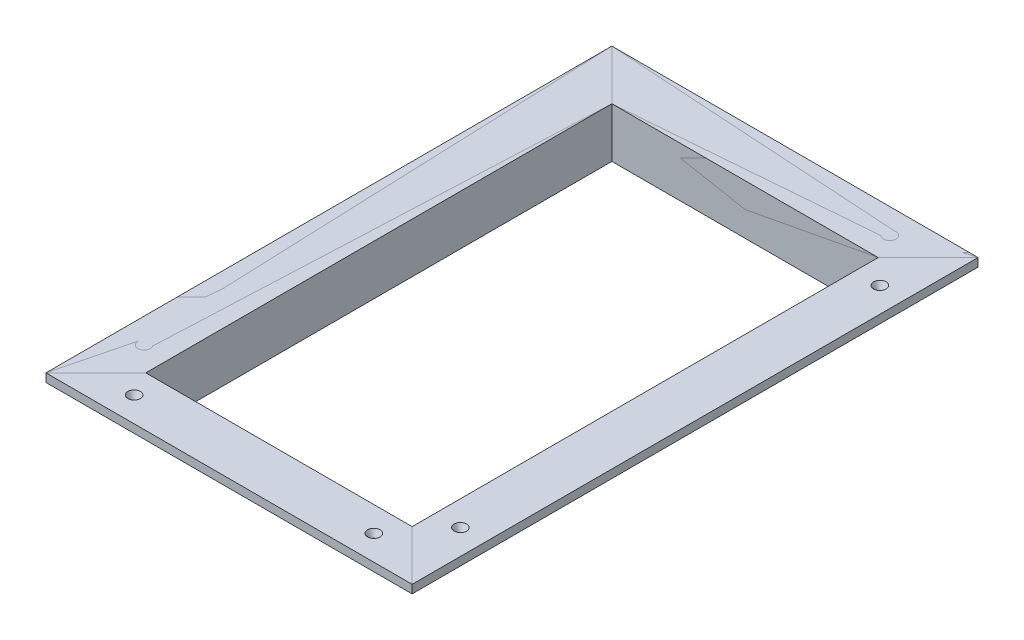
ISO-10303-21;
HEADER;
FILE_DESCRIPTION(('STEP AP214'),'2;1');
FILE_NAME('part.step','',(''),(''),'','','');
FILE_SCHEMA(('AUTOMOTIVE_DESIGN { 1 0 10303 214 1 1 1 1 }'));
ENDSEC;
DATA;
#1=APPLICATION_CONTEXT('core data for automotive mechanical design processes');
#2=APPLICATION_PROTOCOL_DEFINITION('international standard','automotive_design',2000,#1);
#3=PRODUCT_CONTEXT('',#1,'mechanical');
#4=PRODUCT('Part','Part','',(#3));
#5=PRODUCT_RELATED_PRODUCT_CATEGORY('part','',(#4));
#6=PRODUCT_DEFINITION_FORMATION('','',#4);
#7=PRODUCT_DEFINITION_CONTEXT('part definition',#1,'design');
#8=PRODUCT_DEFINITION('design','',#6,#7);
#9=PRODUCT_DEFINITION_SHAPE('','',#8);
#10=(LENGTH_UNIT() NAMED_UNIT(*) SI_UNIT(.MILLI.,.METRE.));
#11=(NAMED_UNIT(*) PLANE_ANGLE_UNIT() SI_UNIT($,.RADIAN.));
#12=(NAMED_UNIT(*) SI_UNIT($,.STERADIAN.) SOLID_ANGLE_UNIT());
#13=UNCERTAINTY_MEASURE_WITH_UNIT(LENGTH_MEASURE(1.E-05),#10,'distance_accuracy_value','');
#14=(GEOMETRIC_REPRESENTATION_CONTEXT(3) GLOBAL_UNCERTAINTY_ASSIGNED_CONTEXT((#13)) GLOBAL_UNIT_ASSIGNED_CONTEXT((#10,
#11,#12)) REPRESENTATION_CONTEXT('',''));
#15=CARTESIAN_POINT('',(0.,0.,0.));
#16=DIRECTION('',(0.,0.,1.));
#17=DIRECTION('',(1.,0.,0.));
#18=AXIS2_PLACEMENT_3D('',#15,#16,#17);
#19=CARTESIAN_POINT('',(139.7,1.01770443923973E-13,88.9));
#20=DIRECTION('',(0.,-1.,0.));
#21=DIRECTION('',(0.,0.,-1.));
#22=AXIS2_PLACEMENT_3D('',#19,#20,#21);
#23=PLANE('',#22);
#24=DIRECTION('',(0.,0.,-1.));
#25=VECTOR('',#24,1.);
#26=CARTESIAN_POINT('',(19.05,0.,88.9));
#27=LINE('',#26,#25);
#28=CARTESIAN_POINT('',(19.05,0.,88.8640789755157));
#29=VERTEX_POINT('',#28);
#30=CARTESIAN_POINT('',(19.05,0.,-88.8640789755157));
#31=VERTEX_POINT('',#30);
#32=EDGE_CURVE('E124',#29,#31,#27,.T.);
#33=ORIENTED_EDGE('',*,*,#32,.T.);
#34=DIRECTION('',(-0.707106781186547,0.,-0.707106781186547));
#35=VECTOR('',#34,1.);
#36=CARTESIAN_POINT('',(19.0320394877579,0.,-88.8820394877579));
#37=LINE('',#36,#35);
#38=CARTESIAN_POINT('',(0.,-1.01770443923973E-13,-107.914078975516));
#39=VERTEX_POINT('',#38);
#40=EDGE_CURVE('E55',#31,#39,#37,.T.);
#41=ORIENTED_EDGE('',*,*,#40,.T.);
#42=DIRECTION('',(0.,0.,-1.));
#43=VECTOR('',#42,1.);
#44=CARTESIAN_POINT('',(0.,-1.01770443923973E-13,-88.9));
#45=LINE('',#44,#43);
#46=CARTESIAN_POINT('',(0.,-1.01770443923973E-13,107.914078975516));
#47=VERTEX_POINT('',#46);
#48=EDGE_CURVE('E104',#47,#39,#45,.T.);
#49=ORIENTED_EDGE('',*,*,#48,.F.);
#50=DIRECTION('',(0.707106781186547,0.,-0.707106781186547));
#51=VECTOR('',#50,1.);
#52=CARTESIAN_POINT('',(19.0320394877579,0.,88.8820394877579));
#53=LINE('',#52,#51);
#54=EDGE_CURVE('E115',#47,#29,#53,.T.);
#55=ORIENTED_EDGE('',*,*,#54,.T.);
#56=EDGE_LOOP('',(#33,#41,#49,#55));
#57=FACE_BOUND('',#56,.T.);
#58=CARTESIAN_POINT('',(9.52500000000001,0.,-80.01));
#59=DIRECTION('',(0.,1.,0.));
#60=DIRECTION('',(0.,0.,-1.));
#61=AXIS2_PLACEMENT_3D('',#58,#59,#60);
#62=CIRCLE('',#61,2.38125);
#63=CARTESIAN_POINT('',(9.52500000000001,0.,-82.39125));
#64=VERTEX_POINT('',#63);
#65=EDGE_CURVE('E147',#64,#64,#62,.T.);
#66=ORIENTED_EDGE('',*,*,#65,.F.);
#67=EDGE_LOOP('',(#66));
#68=FACE_BOUND('',#67,.T.);
#69=CARTESIAN_POINT('',(9.52500000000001,0.,80.01));
#70=DIRECTION('',(0.,1.,0.));
#71=DIRECTION('',(0.,0.,-1.));
#72=AXIS2_PLACEMENT_3D('',#69,#70,#71);
#73=CIRCLE('',#72,2.38125);
#74=CARTESIAN_POINT('',(9.52500000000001,0.,77.62875));
#75=VERTEX_POINT('',#74);
#76=EDGE_CURVE('E320',#75,#75,#73,.T.);
#77=ORIENTED_EDGE('',*,*,#76,.F.);
#78=EDGE_LOOP('',(#77));
#79=FACE_BOUND('',#78,.T.);
#80=ADVANCED_FACE('F46',(#57,#68,#79),#23,.F.);
#81=CARTESIAN_POINT('',(139.7,-3.1749999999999,88.9));
#82=DIRECTION('',(0.,1.,0.));
#83=DIRECTION('',(0.,0.,1.));
#84=AXIS2_PLACEMENT_3D('',#81,#82,#83);
#85=PLANE('',#84);
#86=DIRECTION('',(0.,0.,1.));
#87=VECTOR('',#86,1.);
#88=CARTESIAN_POINT('',(0.,-3.17500000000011,-88.9));
#89=LINE('',#88,#87);
#90=CARTESIAN_POINT('',(0.,-3.1750000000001,-107.914078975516));
#91=VERTEX_POINT('',#90);
#92=CARTESIAN_POINT('',(0.,-3.1750000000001,107.914078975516));
#93=VERTEX_POINT('',#92);
#94=EDGE_CURVE('E107',#91,#93,#89,.T.);
#95=ORIENTED_EDGE('',*,*,#94,.F.);
#96=DIRECTION('',(-0.707106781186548,0.,-0.707106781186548));
#97=VECTOR('',#96,1.);
#98=CARTESIAN_POINT('',(168.257039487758,-3.17499999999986,60.3429605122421));
#99=LINE('',#98,#97);
#100=CARTESIAN_POINT('',(15.875,-3.175,-92.0390789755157));
#101=VERTEX_POINT('',#100);
#102=EDGE_CURVE('E135',#101,#91,#99,.T.);
#103=ORIENTED_EDGE('',*,*,#102,.F.);
#104=DIRECTION('',(0.,0.,-1.));
#105=VECTOR('',#104,1.);
#106=CARTESIAN_POINT('',(15.875,-3.175,88.9));
#107=LINE('',#106,#105);
#108=CARTESIAN_POINT('',(15.875,-3.17500000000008,92.0390789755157));
#109=VERTEX_POINT('',#108);
#110=EDGE_CURVE('E111',#109,#101,#107,.T.);
#111=ORIENTED_EDGE('',*,*,#110,.F.);
#112=DIRECTION('',(0.707106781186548,0.,-0.707106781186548));
#113=VECTOR('',#112,1.);
#114=CARTESIAN_POINT('',(79.3570394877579,-3.17499999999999,28.5570394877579));
#115=LINE('',#114,#113);
#116=EDGE_CURVE('E160',#93,#109,#115,.T.);
#117=ORIENTED_EDGE('',*,*,#116,.F.);
#118=EDGE_LOOP('',(#95,#103,#111,#117));
#119=FACE_BOUND('',#118,.T.);
#120=CARTESIAN_POINT('',(9.52500000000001,-3.17500000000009,-80.01));
#121=DIRECTION('',(0.,-1.,0.));
#122=DIRECTION('',(0.,0.,1.));
#123=AXIS2_PLACEMENT_3D('',#120,#121,#122);
#124=CIRCLE('',#123,1.10252215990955);
#125=CARTESIAN_POINT('',(9.52500000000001,-3.17500000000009,-78.9074778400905));
#126=VERTEX_POINT('',#125);
#127=EDGE_CURVE('E121',#126,#126,#124,.F.);
#128=ORIENTED_EDGE('',*,*,#127,.T.);
#129=EDGE_LOOP('',(#128));
#130=FACE_BOUND('',#129,.T.);
#131=CARTESIAN_POINT('',(9.52500000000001,-3.17500000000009,80.01));
#132=DIRECTION('',(0.,-1.,0.));
#133=DIRECTION('',(0.,0.,1.));
#134=AXIS2_PLACEMENT_3D('',#131,#132,#133);
#135=CIRCLE('',#134,1.10252215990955);
#136=CARTESIAN_POINT('',(9.52500000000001,-3.17500000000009,81.1125221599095));
#137=VERTEX_POINT('',#136);
#138=EDGE_CURVE('E50',#137,#137,#135,.F.);
#139=ORIENTED_EDGE('',*,*,#138,.T.);
#140=EDGE_LOOP('',(#139));
#141=FACE_BOUND('',#140,.T.);
#142=ADVANCED_FACE('F48',(#119,#130,#141),#85,.F.);
#143=CARTESIAN_POINT('',(19.0320394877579,-19.0500250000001,-88.8820394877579));
#144=DIRECTION('',(-0.707106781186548,0.,0.707106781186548));
#145=DIRECTION('',(-0.707106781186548,0.,-0.707106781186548));
#146=AXIS2_PLACEMENT_3D('',#143,#144,#145);
#147=PLANE('',#146);
#148=DIRECTION('',(0.,-1.,0.));
#149=VECTOR('',#148,1.);
#150=CARTESIAN_POINT('',(2.22044604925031E-13,-144.167881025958,-107.914078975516));
#151=LINE('',#150,#149);
#152=EDGE_CURVE('E71',#39,#91,#151,.T.);
#153=ORIENTED_EDGE('',*,*,#152,.F.);
#154=ORIENTED_EDGE('',*,*,#40,.F.);
#155=DIRECTION('',(0.,-1.,0.));
#156=VECTOR('',#155,1.);
#157=CARTESIAN_POINT('',(19.05,2.58999702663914E-13,-88.8640789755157));
#158=LINE('',#157,#156);
#159=CARTESIAN_POINT('',(19.05,-19.05,-88.8640789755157));
#160=VERTEX_POINT('',#159);
#161=EDGE_CURVE('E127',#31,#160,#158,.T.);
#162=ORIENTED_EDGE('',*,*,#161,.T.);
#163=DIRECTION('',(-0.707106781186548,0.,-0.707106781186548));
#164=VECTOR('',#163,1.);
#165=CARTESIAN_POINT('',(160.319539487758,-19.0499999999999,52.4054605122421));
#166=LINE('',#165,#164);
#167=CARTESIAN_POINT('',(15.875,-19.0500000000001,-92.0390789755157));
#168=VERTEX_POINT('',#167);
#169=EDGE_CURVE('E125',#160,#168,#166,.T.);
#170=ORIENTED_EDGE('',*,*,#169,.T.);
#171=DIRECTION('',(0.,1.,0.));
#172=VECTOR('',#171,1.);
#173=CARTESIAN_POINT('',(15.875,-3.17499999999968,-92.0390789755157));
#174=LINE('',#173,#172);
#175=EDGE_CURVE('E134',#168,#101,#174,.T.);
#176=ORIENTED_EDGE('',*,*,#175,.T.);
#177=ORIENTED_EDGE('',*,*,#102,.T.);
#178=EDGE_LOOP('',(#153,#154,#162,#170,#176,#177));
#179=FACE_BOUND('',#178,.T.);
#180=ADVANCED_FACE('F171',(#179),#147,.F.);
#181=CARTESIAN_POINT('',(2.22044604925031E-13,-144.167881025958,-88.9));
#182=DIRECTION('',(-1.,0.,0.));
#183=DIRECTION('',(0.,0.,-1.));
#184=AXIS2_PLACEMENT_3D('',#181,#182,#183);
#185=PLANE('',#184);
#186=DIRECTION('',(0.,1.,0.));
#187=VECTOR('',#186,1.);
#188=CARTESIAN_POINT('',(2.22044604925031E-13,-144.167881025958,107.914078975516));
#189=LINE('',#188,#187);
#190=EDGE_CURVE('E100',#93,#47,#189,.T.);
#191=ORIENTED_EDGE('',*,*,#190,.T.);
#192=ORIENTED_EDGE('',*,*,#48,.T.);
#193=ORIENTED_EDGE('',*,*,#152,.T.);
#194=ORIENTED_EDGE('',*,*,#94,.T.);
#195=EDGE_LOOP('',(#191,#192,#193,#194));
#196=FACE_BOUND('',#195,.T.);
#197=ADVANCED_FACE('F102',(#196),#185,.T.);
#198=CARTESIAN_POINT('',(19.05,0.,88.9));
#199=DIRECTION('',(-1.,0.,0.));
#200=DIRECTION('',(0.,1.,0.));
#201=AXIS2_PLACEMENT_3D('',#198,#199,#200);
#202=PLANE('',#201);
#203=DIRECTION('',(0.,0.,-1.));
#204=VECTOR('',#203,1.);
#205=CARTESIAN_POINT('',(19.05,-19.05,88.9));
#206=LINE('',#205,#204);
#207=CARTESIAN_POINT('',(19.05,-19.05,88.8640789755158));
#208=VERTEX_POINT('',#207);
#209=EDGE_CURVE('E130',#208,#160,#206,.T.);
#210=ORIENTED_EDGE('',*,*,#209,.T.);
#211=ORIENTED_EDGE('',*,*,#161,.F.);
#212=ORIENTED_EDGE('',*,*,#32,.F.);
#213=DIRECTION('',(0.,1.,0.));
#214=VECTOR('',#213,1.);
#215=CARTESIAN_POINT('',(19.05,0.,88.8640789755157));
#216=LINE('',#215,#214);
#217=EDGE_CURVE('E112',#208,#29,#216,.T.);
#218=ORIENTED_EDGE('',*,*,#217,.F.);
#219=EDGE_LOOP('',(#210,#211,#212,#218));
#220=FACE_BOUND('',#219,.T.);
#221=ADVANCED_FACE('F173',(#220),#202,.F.);
#222=CARTESIAN_POINT('',(15.875,-3.175,88.9));
#223=DIRECTION('',(1.,0.,0.));
#224=DIRECTION('',(0.,-1.,0.));
#225=AXIS2_PLACEMENT_3D('',#222,#223,#224);
#226=PLANE('',#225);
#227=ORIENTED_EDGE('',*,*,#110,.T.);
#228=ORIENTED_EDGE('',*,*,#175,.F.);
#229=DIRECTION('',(0.,0.,-1.));
#230=VECTOR('',#229,1.);
#231=CARTESIAN_POINT('',(15.875,-19.05,88.9));
#232=LINE('',#231,#230);
#233=CARTESIAN_POINT('',(15.875,-19.05,92.0390789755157));
#234=VERTEX_POINT('',#233);
#235=EDGE_CURVE('E138',#234,#168,#232,.T.);
#236=ORIENTED_EDGE('',*,*,#235,.F.);
#237=DIRECTION('',(0.,-1.,0.));
#238=VECTOR('',#237,1.);
#239=CARTESIAN_POINT('',(15.875,-3.17499999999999,92.0390789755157));
#240=LINE('',#239,#238);
#241=EDGE_CURVE('E12',#109,#234,#240,.T.);
#242=ORIENTED_EDGE('',*,*,#241,.F.);
#243=EDGE_LOOP('',(#227,#228,#236,#242));
#244=FACE_BOUND('',#243,.T.);
#245=ADVANCED_FACE('F168',(#244),#226,.F.);
#246=CARTESIAN_POINT('',(123.825,-19.0499999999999,88.9));
#247=DIRECTION('',(0.,1.,0.));
#248=DIRECTION('',(0.,0.,1.));
#249=AXIS2_PLACEMENT_3D('',#246,#247,#248);
#250=PLANE('',#249);
#251=ORIENTED_EDGE('',*,*,#235,.T.);
#252=ORIENTED_EDGE('',*,*,#169,.F.);
#253=ORIENTED_EDGE('',*,*,#209,.F.);
#254=DIRECTION('',(0.707106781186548,0.,-0.707106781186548));
#255=VECTOR('',#254,1.);
#256=CARTESIAN_POINT('',(71.4195394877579,-19.05,36.4945394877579));
#257=LINE('',#256,#255);
#258=EDGE_CURVE('E63',#234,#208,#257,.T.);
#259=ORIENTED_EDGE('',*,*,#258,.F.);
#260=EDGE_LOOP('',(#251,#252,#253,#259));
#261=FACE_BOUND('',#260,.T.);
#262=ADVANCED_FACE('F170',(#261),#250,.F.);
#263=CARTESIAN_POINT('',(19.0320394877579,-19.0500250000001,88.8820394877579));
#264=DIRECTION('',(-0.707106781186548,0.,-0.707106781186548));
#265=DIRECTION('',(0.707106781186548,0.,-0.707106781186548));
#266=AXIS2_PLACEMENT_3D('',#263,#264,#265);
#267=PLANE('',#266);
#268=ORIENTED_EDGE('',*,*,#190,.F.);
#269=ORIENTED_EDGE('',*,*,#116,.T.);
#270=ORIENTED_EDGE('',*,*,#241,.T.);
#271=ORIENTED_EDGE('',*,*,#258,.T.);
#272=ORIENTED_EDGE('',*,*,#217,.T.);
#273=ORIENTED_EDGE('',*,*,#54,.F.);
#274=EDGE_LOOP('',(#268,#269,#270,#271,#272,#273));
#275=FACE_BOUND('',#274,.T.);
#276=ADVANCED_FACE('F116',(#275),#267,.F.);
#277=CARTESIAN_POINT('',(9.52500000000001,-4.4892594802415,-80.01));
#278=DIRECTION('',(0.,-1.,0.));
#279=DIRECTION('',(0.,0.,-1.));
#280=AXIS2_PLACEMENT_3D('',#277,#278,#279);
#281=CYLINDRICAL_SURFACE('',#280,1.10252215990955);
#282=CARTESIAN_POINT('',(9.52500000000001,-2.38086751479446,-80.01));
#283=DIRECTION('',(0.,1.,0.));
#284=DIRECTION('',(0.,0.,-1.));
#285=AXIS2_PLACEMENT_3D('',#282,#283,#284);
#286=CIRCLE('',#285,1.10252215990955);
#287=CARTESIAN_POINT('',(9.52500000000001,-2.38086751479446,-81.1125221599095));
#288=VERTEX_POINT('',#287);
#289=EDGE_CURVE('E151',#288,#288,#286,.T.);
#290=ORIENTED_EDGE('',*,*,#289,.T.);
#291=EDGE_LOOP('',(#290));
#292=FACE_BOUND('',#291,.T.);
#293=ORIENTED_EDGE('',*,*,#127,.F.);
#294=EDGE_LOOP('',(#293));
#295=FACE_BOUND('',#294,.T.);
#296=ADVANCED_FACE('F228',(#292,#295),#281,.F.);
#297=CARTESIAN_POINT('',(9.52500000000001,0.,-80.01));
#298=DIRECTION('',(0.,1.,0.));
#299=DIRECTION('',(0.,0.,1.));
#300=AXIS2_PLACEMENT_3D('',#297,#298,#299);
#301=CONICAL_SURFACE('',#300,2.38125,0.492873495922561);
#302=ORIENTED_EDGE('',*,*,#289,.F.);
#303=EDGE_LOOP('',(#302));
#304=FACE_BOUND('',#303,.T.);
#305=ORIENTED_EDGE('',*,*,#65,.T.);
#306=EDGE_LOOP('',(#305));
#307=FACE_BOUND('',#306,.T.);
#308=ADVANCED_FACE('F237',(#304,#307),#301,.F.);
#309=CARTESIAN_POINT('',(9.52500000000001,-4.4892594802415,80.01));
#310=DIRECTION('',(0.,-1.,0.));
#311=DIRECTION('',(0.,0.,-1.));
#312=AXIS2_PLACEMENT_3D('',#309,#310,#311);
#313=CYLINDRICAL_SURFACE('',#312,1.10252215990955);
#314=CARTESIAN_POINT('',(9.52500000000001,-2.38086751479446,80.01));
#315=DIRECTION('',(0.,1.,0.));
#316=DIRECTION('',(0.,0.,-1.));
#317=AXIS2_PLACEMENT_3D('',#314,#315,#316);
#318=CIRCLE('',#317,1.10252215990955);
#319=CARTESIAN_POINT('',(9.52500000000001,-2.38086751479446,78.9074778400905));
#320=VERTEX_POINT('',#319);
#321=EDGE_CURVE('E317',#320,#320,#318,.T.);
#322=ORIENTED_EDGE('',*,*,#321,.T.);
#323=EDGE_LOOP('',(#322));
#324=FACE_BOUND('',#323,.T.);
#325=ORIENTED_EDGE('',*,*,#138,.F.);
#326=EDGE_LOOP('',(#325));
#327=FACE_BOUND('',#326,.T.);
#328=ADVANCED_FACE('F247',(#324,#327),#313,.F.);
#329=CARTESIAN_POINT('',(9.52500000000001,0.,80.01));
#330=DIRECTION('',(0.,1.,0.));
#331=DIRECTION('',(0.,0.,1.));
#332=AXIS2_PLACEMENT_3D('',#329,#330,#331);
#333=CONICAL_SURFACE('',#332,2.38125,0.492873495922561);
#334=ORIENTED_EDGE('',*,*,#321,.F.);
#335=EDGE_LOOP('',(#334));
#336=FACE_BOUND('',#335,.T.);
#337=ORIENTED_EDGE('',*,*,#76,.T.);
#338=EDGE_LOOP('',(#337));
#339=FACE_BOUND('',#338,.T.);
#340=ADVANCED_FACE('F257',(#336,#339),#333,.F.);
#341=CLOSED_SHELL('',(#80,#142,#180,#197,#221,#245,#262,#276,#296,#308,#328,#340));
#342=MANIFOLD_SOLID_BREP('B2',#341);
#343=CARTESIAN_POINT('',(0.,0.,-88.9));
#344=DIRECTION('',(0.,-1.,0.));
#345=DIRECTION('',(0.,0.,1.));
#346=AXIS2_PLACEMENT_3D('',#343,#344,#345);
#347=PLANE('',#346);
#348=DIRECTION('',(-1.,0.,0.));
#349=VECTOR('',#348,1.);
#350=CARTESIAN_POINT('',(0.,0.,-88.9));
#351=LINE('',#350,#349);
#352=CARTESIAN_POINT('',(120.614078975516,0.,-88.9));
#353=VERTEX_POINT('',#352);
#354=CARTESIAN_POINT('',(19.0859210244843,0.,-88.9));
#355=VERTEX_POINT('',#354);
#356=EDGE_CURVE('E440',#353,#355,#351,.T.);
#357=ORIENTED_EDGE('',*,*,#356,.F.);
#358=DIRECTION('',(0.707106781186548,0.,-0.707106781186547));
#359=VECTOR('',#358,1.);
#360=CARTESIAN_POINT('',(139.682039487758,0.,-107.967960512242));
#361=LINE('',#360,#359);
#362=CARTESIAN_POINT('',(139.664078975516,0.,-107.95));
#363=VERTEX_POINT('',#362);
#364=EDGE_CURVE('E424',#353,#363,#361,.T.);
#365=ORIENTED_EDGE('',*,*,#364,.T.);
#366=DIRECTION('',(1.,0.,0.));
#367=VECTOR('',#366,1.);
#368=CARTESIAN_POINT('',(0.,0.,-107.95));
#369=LINE('',#368,#367);
#370=CARTESIAN_POINT('',(0.0359210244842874,0.,-107.95));
#371=VERTEX_POINT('',#370);
#372=EDGE_CURVE('E422',#371,#363,#369,.T.);
#373=ORIENTED_EDGE('',*,*,#372,.F.);
#374=DIRECTION('',(0.707106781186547,0.,0.707106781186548));
#375=VECTOR('',#374,1.);
#376=CARTESIAN_POINT('',(19.0679605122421,0.,-88.9179605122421));
#377=LINE('',#376,#375);
#378=EDGE_CURVE('E446',#371,#355,#377,.T.);
#379=ORIENTED_EDGE('',*,*,#378,.T.);
#380=EDGE_LOOP('',(#357,#365,#373,#379));
#381=FACE_BOUND('',#380,.T.);
#382=CARTESIAN_POINT('',(24.13,0.,-98.425));
#383=DIRECTION('',(0.,1.,0.));
#384=DIRECTION('',(0.,0.,1.));
#385=AXIS2_PLACEMENT_3D('',#382,#383,#384);
#386=CIRCLE('',#385,2.38125);
#387=CARTESIAN_POINT('',(24.13,0.,-96.04375));
#388=VERTEX_POINT('',#387);
#389=EDGE_CURVE('E447',#388,#388,#386,.T.);
#390=ORIENTED_EDGE('',*,*,#389,.F.);
#391=EDGE_LOOP('',(#390));
#392=FACE_BOUND('',#391,.T.);
#393=CARTESIAN_POINT('',(115.57,0.,-98.425));
#394=DIRECTION('',(0.,1.,0.));
#395=DIRECTION('',(0.,0.,1.));
#396=AXIS2_PLACEMENT_3D('',#393,#394,#395);
#397=CIRCLE('',#396,2.38125);
#398=CARTESIAN_POINT('',(115.57,0.,-96.04375));
#399=VERTEX_POINT('',#398);
#400=EDGE_CURVE('E527',#399,#399,#397,.T.);
#401=ORIENTED_EDGE('',*,*,#400,.F.);
#402=EDGE_LOOP('',(#401));
#403=FACE_BOUND('',#402,.T.);
#404=ADVANCED_FACE('F355',(#381,#392,#403),#347,.F.);
#405=CARTESIAN_POINT('',(0.,-3.175,-88.9));
#406=DIRECTION('',(0.,1.,0.));
#407=DIRECTION('',(0.,0.,-1.));
#408=AXIS2_PLACEMENT_3D('',#405,#406,#407);
#409=PLANE('',#408);
#410=DIRECTION('',(-1.,0.,0.));
#411=VECTOR('',#410,1.);
#412=CARTESIAN_POINT('',(15.875,-3.175,-92.075));
#413=LINE('',#412,#411);
#414=CARTESIAN_POINT('',(123.789078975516,-3.175,-92.075));
#415=VERTEX_POINT('',#414);
#416=CARTESIAN_POINT('',(15.9109210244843,-3.175,-92.075));
#417=VERTEX_POINT('',#416);
#418=EDGE_CURVE('E442',#415,#417,#413,.T.);
#419=ORIENTED_EDGE('',*,*,#418,.T.);
#420=DIRECTION('',(0.707106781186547,0.,0.707106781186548));
#421=VECTOR('',#420,1.);
#422=CARTESIAN_POINT('',(9.54296051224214,-3.175,-98.4429605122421));
#423=LINE('',#422,#421);
#424=CARTESIAN_POINT('',(0.0359210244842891,-3.175,-107.95));
#425=VERTEX_POINT('',#424);
#426=EDGE_CURVE('E434',#425,#417,#423,.T.);
#427=ORIENTED_EDGE('',*,*,#426,.F.);
#428=DIRECTION('',(-1.,0.,0.));
#429=VECTOR('',#428,1.);
#430=CARTESIAN_POINT('',(0.,-3.17500000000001,-107.95));
#431=LINE('',#430,#429);
#432=CARTESIAN_POINT('',(139.664078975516,-3.175,-107.95));
#433=VERTEX_POINT('',#432);
#434=EDGE_CURVE('E420',#433,#425,#431,.T.);
#435=ORIENTED_EDGE('',*,*,#434,.F.);
#436=DIRECTION('',(0.707106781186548,0.,-0.707106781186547));
#437=VECTOR('',#436,1.);
#438=CARTESIAN_POINT('',(60.3070394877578,-3.175,-28.5929605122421));
#439=LINE('',#438,#437);
#440=EDGE_CURVE('E427',#415,#433,#439,.T.);
#441=ORIENTED_EDGE('',*,*,#440,.F.);
#442=EDGE_LOOP('',(#419,#427,#435,#441));
#443=FACE_BOUND('',#442,.T.);
#444=CARTESIAN_POINT('',(24.13,-3.175,-98.425));
#445=DIRECTION('',(0.,-1.,0.));
#446=DIRECTION('',(0.,0.,-1.));
#447=AXIS2_PLACEMENT_3D('',#444,#445,#446);
#448=CIRCLE('',#447,1.10252215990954);
#449=CARTESIAN_POINT('',(24.13,-3.175,-99.5275221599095));
#450=VERTEX_POINT('',#449);
#451=EDGE_CURVE('E444',#450,#450,#448,.F.);
#452=ORIENTED_EDGE('',*,*,#451,.T.);
#453=EDGE_LOOP('',(#452));
#454=FACE_BOUND('',#453,.T.);
#455=CARTESIAN_POINT('',(115.57,-3.175,-98.425));
#456=DIRECTION('',(0.,-1.,0.));
#457=DIRECTION('',(0.,0.,-1.));
#458=AXIS2_PLACEMENT_3D('',#455,#456,#457);
#459=CIRCLE('',#458,1.10252215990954);
#460=CARTESIAN_POINT('',(115.57,-3.175,-99.5275221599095));
#461=VERTEX_POINT('',#460);
#462=EDGE_CURVE('E359',#461,#461,#459,.F.);
#463=ORIENTED_EDGE('',*,*,#462,.T.);
#464=EDGE_LOOP('',(#463));
#465=FACE_BOUND('',#464,.T.);
#466=ADVANCED_FACE('F357',(#443,#454,#465),#409,.F.);
#467=CARTESIAN_POINT('',(139.682039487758,-19.050025,-107.967960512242));
#468=DIRECTION('',(-0.707106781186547,0.,-0.707106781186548));
#469=DIRECTION('',(0.707106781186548,0.,-0.707106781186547));
#470=AXIS2_PLACEMENT_3D('',#467,#468,#469);
#471=PLANE('',#470);
#472=DIRECTION('',(0.,1.,0.));
#473=VECTOR('',#472,1.);
#474=CARTESIAN_POINT('',(120.614078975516,-144.167881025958,-88.9));
#475=LINE('',#474,#473);
#476=CARTESIAN_POINT('',(120.614078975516,-19.05,-88.9));
#477=VERTEX_POINT('',#476);
#478=EDGE_CURVE('E393',#477,#353,#475,.T.);
#479=ORIENTED_EDGE('',*,*,#478,.F.);
#480=DIRECTION('',(0.707106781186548,0.,-0.707106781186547));
#481=VECTOR('',#480,1.);
#482=CARTESIAN_POINT('',(68.2445394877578,-19.05,-36.5304605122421));
#483=LINE('',#482,#481);
#484=CARTESIAN_POINT('',(123.789078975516,-19.05,-92.075));
#485=VERTEX_POINT('',#484);
#486=EDGE_CURVE('E435',#477,#485,#483,.T.);
#487=ORIENTED_EDGE('',*,*,#486,.T.);
#488=DIRECTION('',(0.,1.,0.));
#489=VECTOR('',#488,1.);
#490=CARTESIAN_POINT('',(123.789078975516,-127.046681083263,-92.075));
#491=LINE('',#490,#489);
#492=EDGE_CURVE('E412',#485,#415,#491,.T.);
#493=ORIENTED_EDGE('',*,*,#492,.T.);
#494=ORIENTED_EDGE('',*,*,#440,.T.);
#495=DIRECTION('',(0.,-1.,0.));
#496=VECTOR('',#495,1.);
#497=CARTESIAN_POINT('',(139.664078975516,-144.167881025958,-107.95));
#498=LINE('',#497,#496);
#499=EDGE_CURVE('E364',#363,#433,#498,.T.);
#500=ORIENTED_EDGE('',*,*,#499,.F.);
#501=ORIENTED_EDGE('',*,*,#364,.F.);
#502=EDGE_LOOP('',(#479,#487,#493,#494,#500,#501));
#503=FACE_BOUND('',#502,.T.);
#504=ADVANCED_FACE('F428',(#503),#471,.F.);
#505=CARTESIAN_POINT('',(0.,-144.167881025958,-107.95));
#506=DIRECTION('',(0.,0.,-1.));
#507=DIRECTION('',(1.,0.,0.));
#508=AXIS2_PLACEMENT_3D('',#505,#506,#507);
#509=PLANE('',#508);
#510=DIRECTION('',(0.,1.,0.));
#511=VECTOR('',#510,1.);
#512=CARTESIAN_POINT('',(0.0359210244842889,-144.167881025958,-107.95));
#513=LINE('',#512,#511);
#514=EDGE_CURVE('E402',#425,#371,#513,.T.);
#515=ORIENTED_EDGE('',*,*,#514,.T.);
#516=ORIENTED_EDGE('',*,*,#372,.T.);
#517=ORIENTED_EDGE('',*,*,#499,.T.);
#518=ORIENTED_EDGE('',*,*,#434,.T.);
#519=EDGE_LOOP('',(#515,#516,#517,#518));
#520=FACE_BOUND('',#519,.T.);
#521=ADVANCED_FACE('F418',(#520),#509,.T.);
#522=CARTESIAN_POINT('',(0.,-144.167881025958,-88.9));
#523=DIRECTION('',(0.,0.,1.));
#524=DIRECTION('',(-1.,0.,0.));
#525=AXIS2_PLACEMENT_3D('',#522,#523,#524);
#526=PLANE('',#525);
#527=DIRECTION('',(0.,-1.,0.));
#528=VECTOR('',#527,1.);
#529=CARTESIAN_POINT('',(19.0859210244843,-144.167881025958,-88.9));
#530=LINE('',#529,#528);
#531=CARTESIAN_POINT('',(19.0859210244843,-19.05,-88.9));
#532=VERTEX_POINT('',#531);
#533=EDGE_CURVE('E431',#355,#532,#530,.T.);
#534=ORIENTED_EDGE('',*,*,#533,.T.);
#535=DIRECTION('',(-1.,0.,0.));
#536=VECTOR('',#535,1.);
#537=CARTESIAN_POINT('',(15.875,-19.05,-88.9));
#538=LINE('',#537,#536);
#539=EDGE_CURVE('E379',#477,#532,#538,.T.);
#540=ORIENTED_EDGE('',*,*,#539,.F.);
#541=ORIENTED_EDGE('',*,*,#478,.T.);
#542=ORIENTED_EDGE('',*,*,#356,.T.);
#543=EDGE_LOOP('',(#534,#540,#541,#542));
#544=FACE_BOUND('',#543,.T.);
#545=ADVANCED_FACE('F470',(#544),#526,.T.);
#546=CARTESIAN_POINT('',(15.875,-127.046681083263,-92.075));
#547=DIRECTION('',(0.,0.,1.));
#548=DIRECTION('',(-1.,0.,0.));
#549=AXIS2_PLACEMENT_3D('',#546,#547,#548);
#550=PLANE('',#549);
#551=ORIENTED_EDGE('',*,*,#418,.F.);
#552=ORIENTED_EDGE('',*,*,#492,.F.);
#553=DIRECTION('',(1.,0.,0.));
#554=VECTOR('',#553,1.);
#555=CARTESIAN_POINT('',(15.875,-19.05,-92.075));
#556=LINE('',#555,#554);
#557=CARTESIAN_POINT('',(15.9109210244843,-19.05,-92.075));
#558=VERTEX_POINT('',#557);
#559=EDGE_CURVE('E465',#558,#485,#556,.T.);
#560=ORIENTED_EDGE('',*,*,#559,.F.);
#561=DIRECTION('',(0.,-1.,0.));
#562=VECTOR('',#561,1.);
#563=CARTESIAN_POINT('',(15.9109210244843,-127.046681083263,-92.075));
#564=LINE('',#563,#562);
#565=EDGE_CURVE('E44',#417,#558,#564,.T.);
#566=ORIENTED_EDGE('',*,*,#565,.F.);
#567=EDGE_LOOP('',(#551,#552,#560,#566));
#568=FACE_BOUND('',#567,.T.);
#569=ADVANCED_FACE('F481',(#568),#550,.F.);
#570=CARTESIAN_POINT('',(15.875,-19.05,-88.9));
#571=DIRECTION('',(0.,1.,0.));
#572=DIRECTION('',(0.,0.,-1.));
#573=AXIS2_PLACEMENT_3D('',#570,#571,#572);
#574=PLANE('',#573);
#575=ORIENTED_EDGE('',*,*,#559,.T.);
#576=ORIENTED_EDGE('',*,*,#486,.F.);
#577=ORIENTED_EDGE('',*,*,#539,.T.);
#578=DIRECTION('',(0.707106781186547,0.,0.707106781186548));
#579=VECTOR('',#578,1.);
#580=CARTESIAN_POINT('',(17.4804605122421,-19.05,-90.5054605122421));
#581=LINE('',#580,#579);
#582=EDGE_CURVE('E372',#558,#532,#581,.T.);
#583=ORIENTED_EDGE('',*,*,#582,.F.);
#584=EDGE_LOOP('',(#575,#576,#577,#583));
#585=FACE_BOUND('',#584,.T.);
#586=ADVANCED_FACE('F482',(#585),#574,.F.);
#587=CARTESIAN_POINT('',(19.0679605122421,-19.050025,-88.9179605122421));
#588=DIRECTION('',(0.707106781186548,0.,-0.707106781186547));
#589=DIRECTION('',(0.707106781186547,0.,0.707106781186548));
#590=AXIS2_PLACEMENT_3D('',#587,#588,#589);
#591=PLANE('',#590);
#592=ORIENTED_EDGE('',*,*,#533,.F.);
#593=ORIENTED_EDGE('',*,*,#378,.F.);
#594=ORIENTED_EDGE('',*,*,#514,.F.);
#595=ORIENTED_EDGE('',*,*,#426,.T.);
#596=ORIENTED_EDGE('',*,*,#565,.T.);
#597=ORIENTED_EDGE('',*,*,#582,.T.);
#598=EDGE_LOOP('',(#592,#593,#594,#595,#596,#597));
#599=FACE_BOUND('',#598,.T.);
#600=ADVANCED_FACE('F476',(#599),#591,.F.);
#601=CARTESIAN_POINT('',(24.13,-4.48925948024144,-98.425));
#602=DIRECTION('',(0.,-1.,0.));
#603=DIRECTION('',(0.,0.,1.));
#604=AXIS2_PLACEMENT_3D('',#601,#602,#603);
#605=CYLINDRICAL_SURFACE('',#604,1.10252215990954);
#606=CARTESIAN_POINT('',(24.13,-2.38086751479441,-98.425));
#607=DIRECTION('',(0.,1.,0.));
#608=DIRECTION('',(0.,0.,1.));
#609=AXIS2_PLACEMENT_3D('',#606,#607,#608);
#610=CIRCLE('',#609,1.10252215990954);
#611=CARTESIAN_POINT('',(24.13,-2.38086751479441,-97.3224778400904));
#612=VERTEX_POINT('',#611);
#613=EDGE_CURVE('E452',#612,#612,#610,.T.);
#614=ORIENTED_EDGE('',*,*,#613,.T.);
#615=EDGE_LOOP('',(#614));
#616=FACE_BOUND('',#615,.T.);
#617=ORIENTED_EDGE('',*,*,#451,.F.);
#618=EDGE_LOOP('',(#617));
#619=FACE_BOUND('',#618,.T.);
#620=ADVANCED_FACE('F488',(#616,#619),#605,.F.);
#621=CARTESIAN_POINT('',(24.13,0.,-98.425));
#622=DIRECTION('',(0.,1.,0.));
#623=DIRECTION('',(0.,0.,-1.));
#624=AXIS2_PLACEMENT_3D('',#621,#622,#623);
#625=CONICAL_SURFACE('',#624,2.38125,0.492873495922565);
#626=ORIENTED_EDGE('',*,*,#613,.F.);
#627=EDGE_LOOP('',(#626));
#628=FACE_BOUND('',#627,.T.);
#629=ORIENTED_EDGE('',*,*,#389,.T.);
#630=EDGE_LOOP('',(#629));
#631=FACE_BOUND('',#630,.T.);
#632=ADVANCED_FACE('F505',(#628,#631),#625,.F.);
#633=CARTESIAN_POINT('',(115.57,-4.48925948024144,-98.425));
#634=DIRECTION('',(0.,-1.,0.));
#635=DIRECTION('',(0.,0.,1.));
#636=AXIS2_PLACEMENT_3D('',#633,#634,#635);
#637=CYLINDRICAL_SURFACE('',#636,1.10252215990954);
#638=CARTESIAN_POINT('',(115.57,-2.38086751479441,-98.425));
#639=DIRECTION('',(0.,1.,0.));
#640=DIRECTION('',(0.,0.,1.));
#641=AXIS2_PLACEMENT_3D('',#638,#639,#640);
#642=CIRCLE('',#641,1.10252215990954);
#643=CARTESIAN_POINT('',(115.57,-2.38086751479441,-97.3224778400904));
#644=VERTEX_POINT('',#643);
#645=EDGE_CURVE('E523',#644,#644,#642,.T.);
#646=ORIENTED_EDGE('',*,*,#645,.T.);
#647=EDGE_LOOP('',(#646));
#648=FACE_BOUND('',#647,.T.);
#649=ORIENTED_EDGE('',*,*,#462,.F.);
#650=EDGE_LOOP('',(#649));
#651=FACE_BOUND('',#650,.T.);
#652=ADVANCED_FACE('F508',(#648,#651),#637,.F.);
#653=CARTESIAN_POINT('',(115.57,0.,-98.425));
#654=DIRECTION('',(0.,1.,0.));
#655=DIRECTION('',(0.,0.,-1.));
#656=AXIS2_PLACEMENT_3D('',#653,#654,#655);
#657=CONICAL_SURFACE('',#656,2.38125,0.492873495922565);
#658=ORIENTED_EDGE('',*,*,#645,.F.);
#659=EDGE_LOOP('',(#658));
#660=FACE_BOUND('',#659,.T.);
#661=ORIENTED_EDGE('',*,*,#400,.T.);
#662=EDGE_LOOP('',(#661));
#663=FACE_BOUND('',#662,.T.);
#664=ADVANCED_FACE('F513',(#660,#663),#657,.F.);
#665=CLOSED_SHELL('',(#404,#466,#504,#521,#545,#569,#586,#600,#620,#632,#652,#664));
#666=MANIFOLD_SOLID_BREP('B6',#665);
#667=CARTESIAN_POINT('',(0.,-3.175,88.9));
#668=DIRECTION('',(0.,1.,0.));
#669=DIRECTION('',(0.,0.,1.));
#670=AXIS2_PLACEMENT_3D('',#667,#668,#669);
#671=PLANE('',#670);
#672=DIRECTION('',(0.,0.,-1.));
#673=VECTOR('',#672,1.);
#674=CARTESIAN_POINT('',(15.875,-3.175,88.9));
#675=LINE('',#674,#673);
#676=CARTESIAN_POINT('',(15.875,-3.175,92.0390789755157));
#677=VERTEX_POINT('',#676);
#678=CARTESIAN_POINT('',(15.875,-3.175,-92.0390789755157));
#679=VERTEX_POINT('',#678);
#680=EDGE_CURVE('E742',#677,#679,#675,.T.);
#681=ORIENTED_EDGE('',*,*,#680,.F.);
#682=DIRECTION('',(-0.707106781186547,0.,0.707106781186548));
#683=VECTOR('',#682,1.);
#684=CARTESIAN_POINT('',(9.50703948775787,-3.175,98.4070394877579));
#685=LINE('',#684,#683);
#686=CARTESIAN_POINT('',(0.,-3.175,107.914078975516));
#687=VERTEX_POINT('',#686);
#688=EDGE_CURVE('E739',#677,#687,#685,.T.);
#689=ORIENTED_EDGE('',*,*,#688,.T.);
#690=DIRECTION('',(0.,0.,-1.));
#691=VECTOR('',#690,1.);
#692=CARTESIAN_POINT('',(0.,-3.175,88.9));
#693=LINE('',#692,#691);
#694=CARTESIAN_POINT('',(0.,-3.175,-107.914078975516));
#695=VERTEX_POINT('',#694);
#696=EDGE_CURVE('E741',#687,#695,#693,.T.);
#697=ORIENTED_EDGE('',*,*,#696,.T.);
#698=DIRECTION('',(0.707106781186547,0.,0.707106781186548));
#699=VECTOR('',#698,1.);
#700=CARTESIAN_POINT('',(98.4070394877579,-3.175,-9.5070394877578));
#701=LINE('',#700,#699);
#702=EDGE_CURVE('E744',#695,#679,#701,.T.);
#703=ORIENTED_EDGE('',*,*,#702,.T.);
#704=EDGE_LOOP('',(#681,#689,#697,#703));
#705=FACE_BOUND('',#704,.T.);
#706=ADVANCED_FACE('F654',(#705),#671,.F.);
#707=CARTESIAN_POINT('',(15.875,-19.05,88.9));
#708=DIRECTION('',(0.,1.,0.));
#709=DIRECTION('',(0.,0.,1.));
#710=AXIS2_PLACEMENT_3D('',#707,#708,#709);
#711=PLANE('',#710);
#712=DIRECTION('',(0.,0.,-1.));
#713=VECTOR('',#712,1.);
#714=CARTESIAN_POINT('',(19.05,-19.05,88.9));
#715=LINE('',#714,#713);
#716=CARTESIAN_POINT('',(19.05,-19.05,88.8640789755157));
#717=VERTEX_POINT('',#716);
#718=CARTESIAN_POINT('',(19.05,-19.05,-88.8640789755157));
#719=VERTEX_POINT('',#718);
#720=EDGE_CURVE('E705',#717,#719,#715,.T.);
#721=ORIENTED_EDGE('',*,*,#720,.F.);
#722=DIRECTION('',(-0.707106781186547,0.,0.707106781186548));
#723=VECTOR('',#722,1.);
#724=CARTESIAN_POINT('',(17.4445394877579,-19.05,90.4695394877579));
#725=LINE('',#724,#723);
#726=CARTESIAN_POINT('',(15.875,-19.05,92.0390789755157));
#727=VERTEX_POINT('',#726);
#728=EDGE_CURVE('E687',#717,#727,#725,.T.);
#729=ORIENTED_EDGE('',*,*,#728,.T.);
#730=DIRECTION('',(0.,0.,-1.));
#731=VECTOR('',#730,1.);
#732=CARTESIAN_POINT('',(15.875,-19.05,88.9));
#733=LINE('',#732,#731);
#734=CARTESIAN_POINT('',(15.875,-19.05,-92.0390789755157));
#735=VERTEX_POINT('',#734);
#736=EDGE_CURVE('E726',#727,#735,#733,.T.);
#737=ORIENTED_EDGE('',*,*,#736,.T.);
#738=DIRECTION('',(0.707106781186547,0.,0.707106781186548));
#739=VECTOR('',#738,1.);
#740=CARTESIAN_POINT('',(106.344539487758,-19.05,-1.56953948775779));
#741=LINE('',#740,#739);
#742=EDGE_CURVE('E719',#735,#719,#741,.T.);
#743=ORIENTED_EDGE('',*,*,#742,.T.);
#744=EDGE_LOOP('',(#721,#729,#737,#743));
#745=FACE_BOUND('',#744,.T.);
#746=ADVANCED_FACE('F724',(#745),#711,.F.);
#747=CARTESIAN_POINT('',(0.,0.,88.9));
#748=DIRECTION('',(0.,-1.,0.));
#749=DIRECTION('',(0.,0.,-1.));
#750=AXIS2_PLACEMENT_3D('',#747,#748,#749);
#751=PLANE('',#750);
#752=DIRECTION('',(0.,0.,-1.));
#753=VECTOR('',#752,1.);
#754=CARTESIAN_POINT('',(0.,0.,88.9));
#755=LINE('',#754,#753);
#756=CARTESIAN_POINT('',(0.,0.,107.914078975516));
#757=VERTEX_POINT('',#756);
#758=CARTESIAN_POINT('',(0.,0.,-107.914078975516));
#759=VERTEX_POINT('',#758);
#760=EDGE_CURVE('E738',#757,#759,#755,.T.);
#761=ORIENTED_EDGE('',*,*,#760,.F.);
#762=DIRECTION('',(-0.707106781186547,0.,0.707106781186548));
#763=VECTOR('',#762,1.);
#764=CARTESIAN_POINT('',(19.0320394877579,0.,88.8820394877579));
#765=LINE('',#764,#763);
#766=CARTESIAN_POINT('',(19.05,0.,88.8640789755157));
#767=VERTEX_POINT('',#766);
#768=EDGE_CURVE('E353',#767,#757,#765,.T.);
#769=ORIENTED_EDGE('',*,*,#768,.F.);
#770=DIRECTION('',(0.,0.,-1.));
#771=VECTOR('',#770,1.);
#772=CARTESIAN_POINT('',(19.05,0.,88.9));
#773=LINE('',#772,#771);
#774=CARTESIAN_POINT('',(19.05,0.,-88.8640789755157));
#775=VERTEX_POINT('',#774);
#776=EDGE_CURVE('E727',#767,#775,#773,.T.);
#777=ORIENTED_EDGE('',*,*,#776,.T.);
#778=DIRECTION('',(0.707106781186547,0.,0.707106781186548));
#779=VECTOR('',#778,1.);
#780=CARTESIAN_POINT('',(19.0320394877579,0.,-88.8820394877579));
#781=LINE('',#780,#779);
#782=EDGE_CURVE('E662',#759,#775,#781,.T.);
#783=ORIENTED_EDGE('',*,*,#782,.F.);
#784=EDGE_LOOP('',(#761,#769,#777,#783));
#785=FACE_BOUND('',#784,.T.);
#786=ADVANCED_FACE('F767',(#785),#751,.F.);
#787=CARTESIAN_POINT('',(0.,0.,88.9));
#788=DIRECTION('',(1.,0.,0.));
#789=DIRECTION('',(0.,0.,-1.));
#790=AXIS2_PLACEMENT_3D('',#787,#788,#789);
#791=PLANE('',#790);
#792=ORIENTED_EDGE('',*,*,#696,.F.);
#793=DIRECTION('',(0.,1.,0.));
#794=VECTOR('',#793,1.);
#795=CARTESIAN_POINT('',(0.,0.,107.914078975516));
#796=LINE('',#795,#794);
#797=EDGE_CURVE('E669',#687,#757,#796,.T.);
#798=ORIENTED_EDGE('',*,*,#797,.T.);
#799=ORIENTED_EDGE('',*,*,#760,.T.);
#800=DIRECTION('',(0.,-1.,0.));
#801=VECTOR('',#800,1.);
#802=CARTESIAN_POINT('',(0.,0.,-107.914078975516));
#803=LINE('',#802,#801);
#804=EDGE_CURVE('E743',#759,#695,#803,.T.);
#805=ORIENTED_EDGE('',*,*,#804,.T.);
#806=EDGE_LOOP('',(#792,#798,#799,#805));
#807=FACE_BOUND('',#806,.T.);
#808=ADVANCED_FACE('F763',(#807),#791,.F.);
#809=CARTESIAN_POINT('',(15.875,-3.175,88.9));
#810=DIRECTION('',(1.,0.,0.));
#811=DIRECTION('',(0.,0.,-1.));
#812=AXIS2_PLACEMENT_3D('',#809,#810,#811);
#813=PLANE('',#812);
#814=ORIENTED_EDGE('',*,*,#736,.F.);
#815=DIRECTION('',(0.,1.,0.));
#816=VECTOR('',#815,1.);
#817=CARTESIAN_POINT('',(15.875,-3.175,92.0390789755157));
#818=LINE('',#817,#816);
#819=EDGE_CURVE('E683',#727,#677,#818,.T.);
#820=ORIENTED_EDGE('',*,*,#819,.T.);
#821=ORIENTED_EDGE('',*,*,#680,.T.);
#822=DIRECTION('',(0.,-1.,0.));
#823=VECTOR('',#822,1.);
#824=CARTESIAN_POINT('',(15.875,-3.175,-92.0390789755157));
#825=LINE('',#824,#823);
#826=EDGE_CURVE('E733',#679,#735,#825,.T.);
#827=ORIENTED_EDGE('',*,*,#826,.T.);
#828=EDGE_LOOP('',(#814,#820,#821,#827));
#829=FACE_BOUND('',#828,.T.);
#830=ADVANCED_FACE('F760',(#829),#813,.F.);
#831=CARTESIAN_POINT('',(19.05,0.,88.9));
#832=DIRECTION('',(-1.,0.,0.));
#833=DIRECTION('',(0.,0.,1.));
#834=AXIS2_PLACEMENT_3D('',#831,#832,#833);
#835=PLANE('',#834);
#836=ORIENTED_EDGE('',*,*,#776,.F.);
#837=DIRECTION('',(0.,-1.,0.));
#838=VECTOR('',#837,1.);
#839=CARTESIAN_POINT('',(19.05,0.,88.8640789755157));
#840=LINE('',#839,#838);
#841=EDGE_CURVE('E710',#767,#717,#840,.T.);
#842=ORIENTED_EDGE('',*,*,#841,.T.);
#843=ORIENTED_EDGE('',*,*,#720,.T.);
#844=DIRECTION('',(0.,1.,0.));
#845=VECTOR('',#844,1.);
#846=CARTESIAN_POINT('',(19.05,0.,-88.8640789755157));
#847=LINE('',#846,#845);
#848=EDGE_CURVE('E709',#719,#775,#847,.T.);
#849=ORIENTED_EDGE('',*,*,#848,.T.);
#850=EDGE_LOOP('',(#836,#842,#843,#849));
#851=FACE_BOUND('',#850,.T.);
#852=ADVANCED_FACE('F708',(#851),#835,.F.);
#853=CARTESIAN_POINT('',(19.0320394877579,-19.050025,-88.8820394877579));
#854=DIRECTION('',(-0.707106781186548,0.,0.707106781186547));
#855=DIRECTION('',(0.707106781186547,0.,0.707106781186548));
#856=AXIS2_PLACEMENT_3D('',#853,#854,#855);
#857=PLANE('',#856);
#858=ORIENTED_EDGE('',*,*,#782,.T.);
#859=ORIENTED_EDGE('',*,*,#848,.F.);
#860=ORIENTED_EDGE('',*,*,#742,.F.);
#861=ORIENTED_EDGE('',*,*,#826,.F.);
#862=ORIENTED_EDGE('',*,*,#702,.F.);
#863=ORIENTED_EDGE('',*,*,#804,.F.);
#864=EDGE_LOOP('',(#858,#859,#860,#861,#862,#863));
#865=FACE_BOUND('',#864,.T.);
#866=ADVANCED_FACE('F717',(#865),#857,.F.);
#867=CARTESIAN_POINT('',(19.0320394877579,-19.050025,88.8820394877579));
#868=DIRECTION('',(-0.707106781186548,0.,-0.707106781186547));
#869=DIRECTION('',(-0.707106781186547,0.,0.707106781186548));
#870=AXIS2_PLACEMENT_3D('',#867,#868,#869);
#871=PLANE('',#870);
#872=ORIENTED_EDGE('',*,*,#688,.F.);
#873=ORIENTED_EDGE('',*,*,#819,.F.);
#874=ORIENTED_EDGE('',*,*,#728,.F.);
#875=ORIENTED_EDGE('',*,*,#841,.F.);
#876=ORIENTED_EDGE('',*,*,#768,.T.);
#877=ORIENTED_EDGE('',*,*,#797,.F.);
#878=EDGE_LOOP('',(#872,#873,#874,#875,#876,#877));
#879=FACE_BOUND('',#878,.T.);
#880=ADVANCED_FACE('F768',(#879),#871,.F.);
#881=CLOSED_SHELL('',(#706,#746,#786,#808,#830,#852,#866,#880));
#882=MANIFOLD_SOLID_BREP('B38_NOT_SHOWN',#881);
#883=CARTESIAN_POINT('',(0.,0.,88.9));
#884=DIRECTION('',(0.,-1.,0.));
#885=DIRECTION('',(0.,0.,-1.));
#886=AXIS2_PLACEMENT_3D('',#883,#884,#885);
#887=PLANE('',#886);
#888=DIRECTION('',(-1.,0.,0.));
#889=VECTOR('',#888,1.);
#890=CARTESIAN_POINT('',(0.,0.,88.9));
#891=LINE('',#890,#889);
#892=CARTESIAN_POINT('',(120.614078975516,0.,88.9));
#893=VERTEX_POINT('',#892);
#894=CARTESIAN_POINT('',(19.0859210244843,0.,88.9));
#895=VERTEX_POINT('',#894);
#896=EDGE_CURVE('E968',#893,#895,#891,.T.);
#897=ORIENTED_EDGE('',*,*,#896,.T.);
#898=DIRECTION('',(0.707106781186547,0.,-0.707106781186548));
#899=VECTOR('',#898,1.);
#900=CARTESIAN_POINT('',(19.0679605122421,0.,88.9179605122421));
#901=LINE('',#900,#899);
#902=CARTESIAN_POINT('',(0.0359210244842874,0.,107.95));
#903=VERTEX_POINT('',#902);
#904=EDGE_CURVE('E973',#903,#895,#901,.T.);
#905=ORIENTED_EDGE('',*,*,#904,.F.);
#906=DIRECTION('',(1.,0.,0.));
#907=VECTOR('',#906,1.);
#908=CARTESIAN_POINT('',(0.,0.,107.95));
#909=LINE('',#908,#907);
#910=CARTESIAN_POINT('',(139.664078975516,0.,107.95));
#911=VERTEX_POINT('',#910);
#912=EDGE_CURVE('E964',#903,#911,#909,.T.);
#913=ORIENTED_EDGE('',*,*,#912,.T.);
#914=DIRECTION('',(0.707106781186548,0.,0.707106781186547));
#915=VECTOR('',#914,1.);
#916=CARTESIAN_POINT('',(139.682039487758,0.,107.967960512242));
#917=LINE('',#916,#915);
#918=EDGE_CURVE('E947',#893,#911,#917,.T.);
#919=ORIENTED_EDGE('',*,*,#918,.F.);
#920=EDGE_LOOP('',(#897,#905,#913,#919));
#921=FACE_BOUND('',#920,.T.);
#922=CARTESIAN_POINT('',(24.13,0.,98.425));
#923=DIRECTION('',(0.,-1.,0.));
#924=DIRECTION('',(0.,0.,-1.));
#925=AXIS2_PLACEMENT_3D('',#922,#923,#924);
#926=CIRCLE('',#925,2.38125);
#927=CARTESIAN_POINT('',(24.13,0.,96.04375));
#928=VERTEX_POINT('',#927);
#929=EDGE_CURVE('E974',#928,#928,#926,.T.);
#930=ORIENTED_EDGE('',*,*,#929,.T.);
#931=EDGE_LOOP('',(#930));
#932=FACE_BOUND('',#931,.T.);
#933=CARTESIAN_POINT('',(115.57,0.,98.425));
#934=DIRECTION('',(0.,-1.,0.));
#935=DIRECTION('',(0.,0.,-1.));
#936=AXIS2_PLACEMENT_3D('',#933,#934,#935);
#937=CIRCLE('',#936,2.38125);
#938=CARTESIAN_POINT('',(115.57,0.,96.04375));
#939=VERTEX_POINT('',#938);
#940=EDGE_CURVE('E1148',#939,#939,#937,.T.);
#941=ORIENTED_EDGE('',*,*,#940,.T.);
#942=EDGE_LOOP('',(#941));
#943=FACE_BOUND('',#942,.T.);
#944=ADVANCED_FACE('F889',(#921,#932,#943),#887,.F.);
#945=CARTESIAN_POINT('',(0.,-3.175,88.9));
#946=DIRECTION('',(0.,1.,0.));
#947=DIRECTION('',(0.,0.,1.));
#948=AXIS2_PLACEMENT_3D('',#945,#946,#947);
#949=PLANE('',#948);
#950=DIRECTION('',(-1.,0.,0.));
#951=VECTOR('',#950,1.);
#952=CARTESIAN_POINT('',(0.,-3.17500000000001,107.95));
#953=LINE('',#952,#951);
#954=CARTESIAN_POINT('',(139.664078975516,-3.175,107.95));
#955=VERTEX_POINT('',#954);
#956=CARTESIAN_POINT('',(0.0359210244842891,-3.175,107.95));
#957=VERTEX_POINT('',#956);
#958=EDGE_CURVE('E956',#955,#957,#953,.T.);
#959=ORIENTED_EDGE('',*,*,#958,.T.);
#960=DIRECTION('',(0.707106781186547,0.,-0.707106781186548));
#961=VECTOR('',#960,1.);
#962=CARTESIAN_POINT('',(9.54296051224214,-3.175,98.4429605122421));
#963=LINE('',#962,#961);
#964=CARTESIAN_POINT('',(15.9109210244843,-3.175,92.075));
#965=VERTEX_POINT('',#964);
#966=EDGE_CURVE('E935',#957,#965,#963,.T.);
#967=ORIENTED_EDGE('',*,*,#966,.T.);
#968=DIRECTION('',(-1.,0.,0.));
#969=VECTOR('',#968,1.);
#970=CARTESIAN_POINT('',(15.875,-3.175,92.075));
#971=LINE('',#970,#969);
#972=CARTESIAN_POINT('',(123.789078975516,-3.175,92.075));
#973=VERTEX_POINT('',#972);
#974=EDGE_CURVE('E958',#973,#965,#971,.T.);
#975=ORIENTED_EDGE('',*,*,#974,.F.);
#976=DIRECTION('',(0.707106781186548,0.,0.707106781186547));
#977=VECTOR('',#976,1.);
#978=CARTESIAN_POINT('',(60.3070394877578,-3.175,28.5929605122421));
#979=LINE('',#978,#977);
#980=EDGE_CURVE('E943',#973,#955,#979,.T.);
#981=ORIENTED_EDGE('',*,*,#980,.T.);
#982=EDGE_LOOP('',(#959,#967,#975,#981));
#983=FACE_BOUND('',#982,.T.);
#984=CARTESIAN_POINT('',(24.13,-3.175,98.425));
#985=DIRECTION('',(0.,1.,0.));
#986=DIRECTION('',(0.,0.,1.));
#987=AXIS2_PLACEMENT_3D('',#984,#985,#986);
#988=CIRCLE('',#987,1.10252215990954);
#989=CARTESIAN_POINT('',(24.13,-3.175,99.5275221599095));
#990=VERTEX_POINT('',#989);
#991=EDGE_CURVE('E971',#990,#990,#988,.F.);
#992=ORIENTED_EDGE('',*,*,#991,.F.);
#993=EDGE_LOOP('',(#992));
#994=FACE_BOUND('',#993,.T.);
#995=CARTESIAN_POINT('',(115.57,-3.175,98.425));
#996=DIRECTION('',(0.,1.,0.));
#997=DIRECTION('',(0.,0.,1.));
#998=AXIS2_PLACEMENT_3D('',#995,#996,#997);
#999=CIRCLE('',#998,1.10252215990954);
#1000=CARTESIAN_POINT('',(115.57,-3.175,99.5275221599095));
#1001=VERTEX_POINT('',#1000);
#1002=EDGE_CURVE('E893',#1001,#1001,#999,.F.);
#1003=ORIENTED_EDGE('',*,*,#1002,.F.);
#1004=EDGE_LOOP('',(#1003));
#1005=FACE_BOUND('',#1004,.T.);
#1006=ADVANCED_FACE('F891',(#983,#994,#1005),#949,.F.);
#1007=CARTESIAN_POINT('',(139.682039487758,-19.050025,107.967960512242));
#1008=DIRECTION('',(-0.707106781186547,0.,0.707106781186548));
#1009=DIRECTION('',(0.707106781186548,0.,0.707106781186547));
#1010=AXIS2_PLACEMENT_3D('',#1007,#1008,#1009);
#1011=PLANE('',#1010);
#1012=DIRECTION('',(0.,1.,0.));
#1013=VECTOR('',#1012,1.);
#1014=CARTESIAN_POINT('',(120.614078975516,-144.167881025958,88.9));
#1015=LINE('',#1014,#1013);
#1016=CARTESIAN_POINT('',(120.614078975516,-19.05,88.9));
#1017=VERTEX_POINT('',#1016);
#1018=EDGE_CURVE('E928',#1017,#893,#1015,.T.);
#1019=ORIENTED_EDGE('',*,*,#1018,.T.);
#1020=ORIENTED_EDGE('',*,*,#918,.T.);
#1021=DIRECTION('',(0.,-1.,0.));
#1022=VECTOR('',#1021,1.);
#1023=CARTESIAN_POINT('',(139.664078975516,-144.167881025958,107.95));
#1024=LINE('',#1023,#1022);
#1025=EDGE_CURVE('E898',#911,#955,#1024,.T.);
#1026=ORIENTED_EDGE('',*,*,#1025,.T.);
#1027=ORIENTED_EDGE('',*,*,#980,.F.);
#1028=DIRECTION('',(0.,1.,0.));
#1029=VECTOR('',#1028,1.);
#1030=CARTESIAN_POINT('',(123.789078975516,-127.046681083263,92.075));
#1031=LINE('',#1030,#1029);
#1032=CARTESIAN_POINT('',(123.789078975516,-19.05,92.075));
#1033=VERTEX_POINT('',#1032);
#1034=EDGE_CURVE('E992',#1033,#973,#1031,.T.);
#1035=ORIENTED_EDGE('',*,*,#1034,.F.);
#1036=DIRECTION('',(0.707106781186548,0.,0.707106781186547));
#1037=VECTOR('',#1036,1.);
#1038=CARTESIAN_POINT('',(68.2445394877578,-19.05,36.5304605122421));
#1039=LINE('',#1038,#1037);
#1040=EDGE_CURVE('E914',#1017,#1033,#1039,.T.);
#1041=ORIENTED_EDGE('',*,*,#1040,.F.);
#1042=EDGE_LOOP('',(#1019,#1020,#1026,#1027,#1035,#1041));
#1043=FACE_BOUND('',#1042,.T.);
#1044=ADVANCED_FACE('F946',(#1043),#1011,.F.);
#1045=CARTESIAN_POINT('',(0.,-144.167881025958,107.95));
#1046=DIRECTION('',(0.,0.,1.));
#1047=DIRECTION('',(1.,0.,0.));
#1048=AXIS2_PLACEMENT_3D('',#1045,#1046,#1047);
#1049=PLANE('',#1048);
#1050=DIRECTION('',(0.,1.,0.));
#1051=VECTOR('',#1050,1.);
#1052=CARTESIAN_POINT('',(0.0359210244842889,-144.167881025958,107.95));
#1053=LINE('',#1052,#1051);
#1054=EDGE_CURVE('E962',#957,#903,#1053,.T.);
#1055=ORIENTED_EDGE('',*,*,#1054,.F.);
#1056=ORIENTED_EDGE('',*,*,#958,.F.);
#1057=ORIENTED_EDGE('',*,*,#1025,.F.);
#1058=ORIENTED_EDGE('',*,*,#912,.F.);
#1059=EDGE_LOOP('',(#1055,#1056,#1057,#1058));
#1060=FACE_BOUND('',#1059,.T.);
#1061=ADVANCED_FACE('F961',(#1060),#1049,.T.);
#1062=CARTESIAN_POINT('',(0.,-144.167881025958,88.9));
#1063=DIRECTION('',(0.,0.,-1.));
#1064=DIRECTION('',(-1.,0.,0.));
#1065=AXIS2_PLACEMENT_3D('',#1062,#1063,#1064);
#1066=PLANE('',#1065);
#1067=DIRECTION('',(0.,-1.,0.));
#1068=VECTOR('',#1067,1.);
#1069=CARTESIAN_POINT('',(19.0859210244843,-144.167881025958,88.9));
#1070=LINE('',#1069,#1068);
#1071=CARTESIAN_POINT('',(19.0859210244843,-19.05,88.9));
#1072=VERTEX_POINT('',#1071);
#1073=EDGE_CURVE('E959',#895,#1072,#1070,.T.);
#1074=ORIENTED_EDGE('',*,*,#1073,.F.);
#1075=ORIENTED_EDGE('',*,*,#896,.F.);
#1076=ORIENTED_EDGE('',*,*,#1018,.F.);
#1077=DIRECTION('',(-1.,0.,0.));
#1078=VECTOR('',#1077,1.);
#1079=CARTESIAN_POINT('',(15.875,-19.05,88.9));
#1080=LINE('',#1079,#1078);
#1081=EDGE_CURVE('E995',#1017,#1072,#1080,.T.);
#1082=ORIENTED_EDGE('',*,*,#1081,.T.);
#1083=EDGE_LOOP('',(#1074,#1075,#1076,#1082));
#1084=FACE_BOUND('',#1083,.T.);
#1085=ADVANCED_FACE('F1008',(#1084),#1066,.T.);
#1086=CARTESIAN_POINT('',(15.875,-127.046681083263,92.075));
#1087=DIRECTION('',(0.,0.,-1.));
#1088=DIRECTION('',(-1.,0.,0.));
#1089=AXIS2_PLACEMENT_3D('',#1086,#1087,#1088);
#1090=PLANE('',#1089);
#1091=ORIENTED_EDGE('',*,*,#974,.T.);
#1092=DIRECTION('',(0.,-1.,0.));
#1093=VECTOR('',#1092,1.);
#1094=CARTESIAN_POINT('',(15.9109210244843,-127.046681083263,92.075));
#1095=LINE('',#1094,#1093);
#1096=CARTESIAN_POINT('',(15.9109210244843,-19.05,92.075));
#1097=VERTEX_POINT('',#1096);
#1098=EDGE_CURVE('E652',#965,#1097,#1095,.T.);
#1099=ORIENTED_EDGE('',*,*,#1098,.T.);
#1100=DIRECTION('',(1.,0.,0.));
#1101=VECTOR('',#1100,1.);
#1102=CARTESIAN_POINT('',(15.875,-19.05,92.075));
#1103=LINE('',#1102,#1101);
#1104=EDGE_CURVE('E994',#1097,#1033,#1103,.T.);
#1105=ORIENTED_EDGE('',*,*,#1104,.T.);
#1106=ORIENTED_EDGE('',*,*,#1034,.T.);
#1107=EDGE_LOOP('',(#1091,#1099,#1105,#1106));
#1108=FACE_BOUND('',#1107,.T.);
#1109=ADVANCED_FACE('F1015',(#1108),#1090,.F.);
#1110=CARTESIAN_POINT('',(15.875,-19.05,88.9));
#1111=DIRECTION('',(0.,1.,0.));
#1112=DIRECTION('',(0.,0.,1.));
#1113=AXIS2_PLACEMENT_3D('',#1110,#1111,#1112);
#1114=PLANE('',#1113);
#1115=ORIENTED_EDGE('',*,*,#1104,.F.);
#1116=DIRECTION('',(0.707106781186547,0.,-0.707106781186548));
#1117=VECTOR('',#1116,1.);
#1118=CARTESIAN_POINT('',(17.4804605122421,-19.05,90.5054605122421));
#1119=LINE('',#1118,#1117);
#1120=EDGE_CURVE('E906',#1097,#1072,#1119,.T.);
#1121=ORIENTED_EDGE('',*,*,#1120,.T.);
#1122=ORIENTED_EDGE('',*,*,#1081,.F.);
#1123=ORIENTED_EDGE('',*,*,#1040,.T.);
#1124=EDGE_LOOP('',(#1115,#1121,#1122,#1123));
#1125=FACE_BOUND('',#1124,.T.);
#1126=ADVANCED_FACE('F1013',(#1125),#1114,.F.);
#1127=CARTESIAN_POINT('',(19.0679605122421,-19.050025,88.9179605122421));
#1128=DIRECTION('',(0.707106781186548,0.,0.707106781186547));
#1129=DIRECTION('',(0.707106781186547,0.,-0.707106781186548));
#1130=AXIS2_PLACEMENT_3D('',#1127,#1128,#1129);
#1131=PLANE('',#1130);
#1132=ORIENTED_EDGE('',*,*,#1073,.T.);
#1133=ORIENTED_EDGE('',*,*,#1120,.F.);
#1134=ORIENTED_EDGE('',*,*,#1098,.F.);
#1135=ORIENTED_EDGE('',*,*,#966,.F.);
#1136=ORIENTED_EDGE('',*,*,#1054,.T.);
#1137=ORIENTED_EDGE('',*,*,#904,.T.);
#1138=EDGE_LOOP('',(#1132,#1133,#1134,#1135,#1136,#1137));
#1139=FACE_BOUND('',#1138,.T.);
#1140=ADVANCED_FACE('F1010',(#1139),#1131,.F.);
#1141=CARTESIAN_POINT('',(24.13,-4.48925948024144,98.425));
#1142=DIRECTION('',(0.,-1.,0.));
#1143=DIRECTION('',(0.,0.,-1.));
#1144=AXIS2_PLACEMENT_3D('',#1141,#1142,#1143);
#1145=CYLINDRICAL_SURFACE('',#1144,1.10252215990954);
#1146=CARTESIAN_POINT('',(24.13,-2.38086751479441,98.425));
#1147=DIRECTION('',(0.,-1.,0.));
#1148=DIRECTION('',(0.,0.,-1.));
#1149=AXIS2_PLACEMENT_3D('',#1146,#1147,#1148);
#1150=CIRCLE('',#1149,1.10252215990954);
#1151=CARTESIAN_POINT('',(24.13,-2.38086751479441,97.3224778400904));
#1152=VERTEX_POINT('',#1151);
#1153=EDGE_CURVE('E980',#1152,#1152,#1150,.T.);
#1154=ORIENTED_EDGE('',*,*,#1153,.F.);
#1155=EDGE_LOOP('',(#1154));
#1156=FACE_BOUND('',#1155,.T.);
#1157=ORIENTED_EDGE('',*,*,#991,.T.);
#1158=EDGE_LOOP('',(#1157));
#1159=FACE_BOUND('',#1158,.T.);
#1160=ADVANCED_FACE('F1066',(#1156,#1159),#1145,.F.);
#1161=CARTESIAN_POINT('',(24.13,0.,98.425));
#1162=DIRECTION('',(0.,1.,0.));
#1163=DIRECTION('',(0.,0.,1.));
#1164=AXIS2_PLACEMENT_3D('',#1161,#1162,#1163);
#1165=CONICAL_SURFACE('',#1164,2.38125,0.492873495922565);
#1166=ORIENTED_EDGE('',*,*,#1153,.T.);
#1167=EDGE_LOOP('',(#1166));
#1168=FACE_BOUND('',#1167,.T.);
#1169=ORIENTED_EDGE('',*,*,#929,.F.);
#1170=EDGE_LOOP('',(#1169));
#1171=FACE_BOUND('',#1170,.T.);
#1172=ADVANCED_FACE('F1076',(#1168,#1171),#1165,.F.);
#1173=CARTESIAN_POINT('',(115.57,-4.48925948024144,98.425));
#1174=DIRECTION('',(0.,-1.,0.));
#1175=DIRECTION('',(0.,0.,-1.));
#1176=AXIS2_PLACEMENT_3D('',#1173,#1174,#1175);
#1177=CYLINDRICAL_SURFACE('',#1176,1.10252215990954);
#1178=CARTESIAN_POINT('',(115.57,-2.38086751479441,98.425));
#1179=DIRECTION('',(0.,-1.,0.));
#1180=DIRECTION('',(0.,0.,-1.));
#1181=AXIS2_PLACEMENT_3D('',#1178,#1179,#1180);
#1182=CIRCLE('',#1181,1.10252215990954);
#1183=CARTESIAN_POINT('',(115.57,-2.38086751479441,97.3224778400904));
#1184=VERTEX_POINT('',#1183);
#1185=EDGE_CURVE('E1145',#1184,#1184,#1182,.T.);
#1186=ORIENTED_EDGE('',*,*,#1185,.F.);
#1187=EDGE_LOOP('',(#1186));
#1188=FACE_BOUND('',#1187,.T.);
#1189=ORIENTED_EDGE('',*,*,#1002,.T.);
#1190=EDGE_LOOP('',(#1189));
#1191=FACE_BOUND('',#1190,.T.);
#1192=ADVANCED_FACE('F1087',(#1188,#1191),#1177,.F.);
#1193=CARTESIAN_POINT('',(115.57,0.,98.425));
#1194=DIRECTION('',(0.,1.,0.));
#1195=DIRECTION('',(0.,0.,1.));
#1196=AXIS2_PLACEMENT_3D('',#1193,#1194,#1195);
#1197=CONICAL_SURFACE('',#1196,2.38125,0.492873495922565);
#1198=ORIENTED_EDGE('',*,*,#1185,.T.);
#1199=EDGE_LOOP('',(#1198));
#1200=FACE_BOUND('',#1199,.T.);
#1201=ORIENTED_EDGE('',*,*,#940,.F.);
#1202=EDGE_LOOP('',(#1201));
#1203=FACE_BOUND('',#1202,.T.);
#1204=ADVANCED_FACE('F1097',(#1200,#1203),#1197,.F.);
#1205=CLOSED_SHELL('',(#944,#1006,#1044,#1061,#1085,#1109,#1126,#1140,#1160,#1172,#1192,#1204));
#1206=MANIFOLD_SOLID_BREP('B347',#1205);
#1207=CARTESIAN_POINT('',(0.,0.,88.9));
#1208=DIRECTION('',(0.,-1.,0.));
#1209=DIRECTION('',(0.,0.,-1.));
#1210=AXIS2_PLACEMENT_3D('',#1207,#1208,#1209);
#1211=PLANE('',#1210);
#1212=DIRECTION('',(0.,0.,-1.));
#1213=VECTOR('',#1212,1.);
#1214=CARTESIAN_POINT('',(120.65,0.,88.9));
#1215=LINE('',#1214,#1213);
#1216=CARTESIAN_POINT('',(120.65,0.,88.8640789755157));
#1217=VERTEX_POINT('',#1216);
#1218=CARTESIAN_POINT('',(120.65,0.,-88.8640789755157));
#1219=VERTEX_POINT('',#1218);
#1220=EDGE_CURVE('E1256',#1217,#1219,#1215,.T.);
#1221=ORIENTED_EDGE('',*,*,#1220,.F.);
#1222=DIRECTION('',(-0.707106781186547,0.,-0.707106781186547));
#1223=VECTOR('',#1222,1.);
#1224=CARTESIAN_POINT('',(120.667960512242,0.,88.8820394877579));
#1225=LINE('',#1224,#1223);
#1226=CARTESIAN_POINT('',(139.7,0.,107.914078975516));
#1227=VERTEX_POINT('',#1226);
#1228=EDGE_CURVE('E1244',#1227,#1217,#1225,.T.);
#1229=ORIENTED_EDGE('',*,*,#1228,.F.);
#1230=DIRECTION('',(0.,0.,-1.));
#1231=VECTOR('',#1230,1.);
#1232=CARTESIAN_POINT('',(139.7,0.,-88.9));
#1233=LINE('',#1232,#1231);
#1234=CARTESIAN_POINT('',(139.7,0.,-107.914078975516));
#1235=VERTEX_POINT('',#1234);
#1236=EDGE_CURVE('E1213',#1227,#1235,#1233,.T.);
#1237=ORIENTED_EDGE('',*,*,#1236,.T.);
#1238=DIRECTION('',(0.707106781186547,0.,-0.707106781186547));
#1239=VECTOR('',#1238,1.);
#1240=CARTESIAN_POINT('',(120.667960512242,0.,-88.8820394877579));
#1241=LINE('',#1240,#1239);
#1242=EDGE_CURVE('E1197',#1219,#1235,#1241,.T.);
#1243=ORIENTED_EDGE('',*,*,#1242,.F.);
#1244=EDGE_LOOP('',(#1221,#1229,#1237,#1243));
#1245=FACE_BOUND('',#1244,.T.);
#1246=CARTESIAN_POINT('',(130.175,0.,-80.01));
#1247=DIRECTION('',(0.,-1.,0.));
#1248=DIRECTION('',(0.,0.,-1.));
#1249=AXIS2_PLACEMENT_3D('',#1246,#1247,#1248);
#1250=CIRCLE('',#1249,2.38125);
#1251=CARTESIAN_POINT('',(130.175,0.,-82.39125));
#1252=VERTEX_POINT('',#1251);
#1253=EDGE_CURVE('E1285',#1252,#1252,#1250,.T.);
#1254=ORIENTED_EDGE('',*,*,#1253,.T.);
#1255=EDGE_LOOP('',(#1254));
#1256=FACE_BOUND('',#1255,.T.);
#1257=CARTESIAN_POINT('',(130.175,0.,80.01));
#1258=DIRECTION('',(0.,-1.,0.));
#1259=DIRECTION('',(0.,0.,-1.));
#1260=AXIS2_PLACEMENT_3D('',#1257,#1258,#1259);
#1261=CIRCLE('',#1260,2.38125);
#1262=CARTESIAN_POINT('',(130.175,0.,77.62875));
#1263=VERTEX_POINT('',#1262);
#1264=EDGE_CURVE('E1321',#1263,#1263,#1261,.T.);
#1265=ORIENTED_EDGE('',*,*,#1264,.T.);
#1266=EDGE_LOOP('',(#1265));
#1267=FACE_BOUND('',#1266,.T.);
#1268=ADVANCED_FACE('F1188',(#1245,#1256,#1267),#1211,.F.);
#1269=CARTESIAN_POINT('',(0.,-3.175,88.9));
#1270=DIRECTION('',(0.,1.,0.));
#1271=DIRECTION('',(0.,0.,1.));
#1272=AXIS2_PLACEMENT_3D('',#1269,#1270,#1271);
#1273=PLANE('',#1272);
#1274=DIRECTION('',(0.,0.,1.));
#1275=VECTOR('',#1274,1.);
#1276=CARTESIAN_POINT('',(139.7,-3.17500000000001,-88.9));
#1277=LINE('',#1276,#1275);
#1278=CARTESIAN_POINT('',(139.7,-3.175,-107.914078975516));
#1279=VERTEX_POINT('',#1278);
#1280=CARTESIAN_POINT('',(139.7,-3.175,107.914078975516));
#1281=VERTEX_POINT('',#1280);
#1282=EDGE_CURVE('E1272',#1279,#1281,#1277,.T.);
#1283=ORIENTED_EDGE('',*,*,#1282,.T.);
#1284=DIRECTION('',(-0.707106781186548,0.,-0.707106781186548));
#1285=VECTOR('',#1284,1.);
#1286=CARTESIAN_POINT('',(60.3429605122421,-3.175,28.5570394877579));
#1287=LINE('',#1286,#1285);
#1288=CARTESIAN_POINT('',(123.825,-3.175,92.0390789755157));
#1289=VERTEX_POINT('',#1288);
#1290=EDGE_CURVE('E1247',#1281,#1289,#1287,.T.);
#1291=ORIENTED_EDGE('',*,*,#1290,.T.);
#1292=DIRECTION('',(0.,0.,-1.));
#1293=VECTOR('',#1292,1.);
#1294=CARTESIAN_POINT('',(123.825,-3.17499999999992,88.9));
#1295=LINE('',#1294,#1293);
#1296=CARTESIAN_POINT('',(123.825,-3.17499999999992,-92.0390789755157));
#1297=VERTEX_POINT('',#1296);
#1298=EDGE_CURVE('E1251',#1289,#1297,#1295,.T.);
#1299=ORIENTED_EDGE('',*,*,#1298,.T.);
#1300=DIRECTION('',(0.707106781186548,0.,-0.707106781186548));
#1301=VECTOR('',#1300,1.);
#1302=CARTESIAN_POINT('',(-28.5570394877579,-3.175,60.3429605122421));
#1303=LINE('',#1302,#1301);
#1304=EDGE_CURVE('E1273',#1297,#1279,#1303,.T.);
#1305=ORIENTED_EDGE('',*,*,#1304,.T.);
#1306=EDGE_LOOP('',(#1283,#1291,#1299,#1305));
#1307=FACE_BOUND('',#1306,.T.);
#1308=CARTESIAN_POINT('',(130.175,-3.175,-80.01));
#1309=DIRECTION('',(0.,1.,0.));
#1310=DIRECTION('',(0.,0.,1.));
#1311=AXIS2_PLACEMENT_3D('',#1308,#1309,#1310);
#1312=CIRCLE('',#1311,1.10252215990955);
#1313=CARTESIAN_POINT('',(130.175,-3.175,-78.9074778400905));
#1314=VERTEX_POINT('',#1313);
#1315=EDGE_CURVE('E1257',#1314,#1314,#1312,.F.);
#1316=ORIENTED_EDGE('',*,*,#1315,.F.);
#1317=EDGE_LOOP('',(#1316));
#1318=FACE_BOUND('',#1317,.T.);
#1319=CARTESIAN_POINT('',(130.175,-3.175,80.01));
#1320=DIRECTION('',(0.,1.,0.));
#1321=DIRECTION('',(0.,0.,1.));
#1322=AXIS2_PLACEMENT_3D('',#1319,#1320,#1321);
#1323=CIRCLE('',#1322,1.10252215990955);
#1324=CARTESIAN_POINT('',(130.175,-3.175,81.1125221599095));
#1325=VERTEX_POINT('',#1324);
#1326=EDGE_CURVE('E1192',#1325,#1325,#1323,.F.);
#1327=ORIENTED_EDGE('',*,*,#1326,.F.);
#1328=EDGE_LOOP('',(#1327));
#1329=FACE_BOUND('',#1328,.T.);
#1330=ADVANCED_FACE('F1190',(#1307,#1318,#1329),#1273,.F.);
#1331=CARTESIAN_POINT('',(120.667960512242,-19.050025,-88.8820394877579));
#1332=DIRECTION('',(0.707106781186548,0.,0.707106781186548));
#1333=DIRECTION('',(0.707106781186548,0.,-0.707106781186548));
#1334=AXIS2_PLACEMENT_3D('',#1331,#1332,#1333);
#1335=PLANE('',#1334);
#1336=DIRECTION('',(0.,-1.,0.));
#1337=VECTOR('',#1336,1.);
#1338=CARTESIAN_POINT('',(139.7,-144.167881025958,-107.914078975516));
#1339=LINE('',#1338,#1337);
#1340=EDGE_CURVE('E1261',#1235,#1279,#1339,.T.);
#1341=ORIENTED_EDGE('',*,*,#1340,.T.);
#1342=ORIENTED_EDGE('',*,*,#1304,.F.);
#1343=DIRECTION('',(0.,1.,0.));
#1344=VECTOR('',#1343,1.);
#1345=CARTESIAN_POINT('',(123.825,-3.1749999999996,-92.0390789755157));
#1346=LINE('',#1345,#1344);
#1347=CARTESIAN_POINT('',(123.825,-19.05,-92.0390789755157));
#1348=VERTEX_POINT('',#1347);
#1349=EDGE_CURVE('E1271',#1348,#1297,#1346,.T.);
#1350=ORIENTED_EDGE('',*,*,#1349,.F.);
#1351=DIRECTION('',(0.707106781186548,0.,-0.707106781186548));
#1352=VECTOR('',#1351,1.);
#1353=CARTESIAN_POINT('',(-20.6195394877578,-19.05,52.4054605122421));
#1354=LINE('',#1353,#1352);
#1355=CARTESIAN_POINT('',(120.65,-19.05,-88.8640789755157));
#1356=VERTEX_POINT('',#1355);
#1357=EDGE_CURVE('E1262',#1356,#1348,#1354,.T.);
#1358=ORIENTED_EDGE('',*,*,#1357,.F.);
#1359=DIRECTION('',(0.,-1.,0.));
#1360=VECTOR('',#1359,1.);
#1361=CARTESIAN_POINT('',(120.65,3.33014570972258E-13,-88.8640789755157));
#1362=LINE('',#1361,#1360);
#1363=EDGE_CURVE('E1264',#1219,#1356,#1362,.T.);
#1364=ORIENTED_EDGE('',*,*,#1363,.F.);
#1365=ORIENTED_EDGE('',*,*,#1242,.T.);
#1366=EDGE_LOOP('',(#1341,#1342,#1350,#1358,#1364,#1365));
#1367=FACE_BOUND('',#1366,.T.);
#1368=ADVANCED_FACE('F1313',(#1367),#1335,.F.);
#1369=CARTESIAN_POINT('',(139.7,-144.167881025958,-88.9));
#1370=DIRECTION('',(1.,0.,0.));
#1371=DIRECTION('',(0.,0.,-1.));
#1372=AXIS2_PLACEMENT_3D('',#1369,#1370,#1371);
#1373=PLANE('',#1372);
#1374=DIRECTION('',(0.,1.,0.));
#1375=VECTOR('',#1374,1.);
#1376=CARTESIAN_POINT('',(139.7,-144.167881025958,107.914078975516));
#1377=LINE('',#1376,#1375);
#1378=EDGE_CURVE('E1242',#1281,#1227,#1377,.T.);
#1379=ORIENTED_EDGE('',*,*,#1378,.F.);
#1380=ORIENTED_EDGE('',*,*,#1282,.F.);
#1381=ORIENTED_EDGE('',*,*,#1340,.F.);
#1382=ORIENTED_EDGE('',*,*,#1236,.F.);
#1383=EDGE_LOOP('',(#1379,#1380,#1381,#1382));
#1384=FACE_BOUND('',#1383,.T.);
#1385=ADVANCED_FACE('F1260',(#1384),#1373,.T.);
#1386=CARTESIAN_POINT('',(120.65,0.,88.9));
#1387=DIRECTION('',(1.,0.,0.));
#1388=DIRECTION('',(0.,1.,0.));
#1389=AXIS2_PLACEMENT_3D('',#1386,#1387,#1388);
#1390=PLANE('',#1389);
#1391=DIRECTION('',(0.,0.,-1.));
#1392=VECTOR('',#1391,1.);
#1393=CARTESIAN_POINT('',(120.65,-19.0499999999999,88.9));
#1394=LINE('',#1393,#1392);
#1395=CARTESIAN_POINT('',(120.65,-19.05,88.8640789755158));
#1396=VERTEX_POINT('',#1395);
#1397=EDGE_CURVE('E1267',#1396,#1356,#1394,.T.);
#1398=ORIENTED_EDGE('',*,*,#1397,.F.);
#1399=DIRECTION('',(0.,1.,0.));
#1400=VECTOR('',#1399,1.);
#1401=CARTESIAN_POINT('',(120.65,0.,88.8640789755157));
#1402=LINE('',#1401,#1400);
#1403=EDGE_CURVE('E1252',#1396,#1217,#1402,.T.);
#1404=ORIENTED_EDGE('',*,*,#1403,.T.);
#1405=ORIENTED_EDGE('',*,*,#1220,.T.);
#1406=ORIENTED_EDGE('',*,*,#1363,.T.);
#1407=EDGE_LOOP('',(#1398,#1404,#1405,#1406));
#1408=FACE_BOUND('',#1407,.T.);
#1409=ADVANCED_FACE('F1300',(#1408),#1390,.F.);
#1410=CARTESIAN_POINT('',(123.825,-3.17499999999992,88.9));
#1411=DIRECTION('',(-1.,0.,0.));
#1412=DIRECTION('',(0.,-1.,0.));
#1413=AXIS2_PLACEMENT_3D('',#1410,#1411,#1412);
#1414=PLANE('',#1413);
#1415=ORIENTED_EDGE('',*,*,#1298,.F.);
#1416=DIRECTION('',(0.,-1.,0.));
#1417=VECTOR('',#1416,1.);
#1418=CARTESIAN_POINT('',(123.825,-3.17499999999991,92.0390789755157));
#1419=LINE('',#1418,#1417);
#1420=CARTESIAN_POINT('',(123.825,-19.0499999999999,92.0390789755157));
#1421=VERTEX_POINT('',#1420);
#1422=EDGE_CURVE('E887',#1289,#1421,#1419,.T.);
#1423=ORIENTED_EDGE('',*,*,#1422,.T.);
#1424=DIRECTION('',(0.,0.,-1.));
#1425=VECTOR('',#1424,1.);
#1426=CARTESIAN_POINT('',(123.825,-19.0499999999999,88.9));
#1427=LINE('',#1426,#1425);
#1428=EDGE_CURVE('E1276',#1421,#1348,#1427,.T.);
#1429=ORIENTED_EDGE('',*,*,#1428,.T.);
#1430=ORIENTED_EDGE('',*,*,#1349,.T.);
#1431=EDGE_LOOP('',(#1415,#1423,#1429,#1430));
#1432=FACE_BOUND('',#1431,.T.);
#1433=ADVANCED_FACE('F1310',(#1432),#1414,.F.);
#1434=CARTESIAN_POINT('',(15.875,-19.05,88.9));
#1435=DIRECTION('',(0.,1.,0.));
#1436=DIRECTION('',(0.,0.,1.));
#1437=AXIS2_PLACEMENT_3D('',#1434,#1435,#1436);
#1438=PLANE('',#1437);
#1439=ORIENTED_EDGE('',*,*,#1428,.F.);
#1440=DIRECTION('',(-0.707106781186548,0.,-0.707106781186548));
#1441=VECTOR('',#1440,1.);
#1442=CARTESIAN_POINT('',(68.2804605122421,-19.05,36.4945394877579));
#1443=LINE('',#1442,#1441);
#1444=EDGE_CURVE('E1205',#1421,#1396,#1443,.T.);
#1445=ORIENTED_EDGE('',*,*,#1444,.T.);
#1446=ORIENTED_EDGE('',*,*,#1397,.T.);
#1447=ORIENTED_EDGE('',*,*,#1357,.T.);
#1448=EDGE_LOOP('',(#1439,#1445,#1446,#1447));
#1449=FACE_BOUND('',#1448,.T.);
#1450=ADVANCED_FACE('F1304',(#1449),#1438,.F.);
#1451=CARTESIAN_POINT('',(120.667960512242,-19.050025,88.8820394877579));
#1452=DIRECTION('',(0.707106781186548,0.,-0.707106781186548));
#1453=DIRECTION('',(-0.707106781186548,0.,-0.707106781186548));
#1454=AXIS2_PLACEMENT_3D('',#1451,#1452,#1453);
#1455=PLANE('',#1454);
#1456=ORIENTED_EDGE('',*,*,#1378,.T.);
#1457=ORIENTED_EDGE('',*,*,#1228,.T.);
#1458=ORIENTED_EDGE('',*,*,#1403,.F.);
#1459=ORIENTED_EDGE('',*,*,#1444,.F.);
#1460=ORIENTED_EDGE('',*,*,#1422,.F.);
#1461=ORIENTED_EDGE('',*,*,#1290,.F.);
#1462=EDGE_LOOP('',(#1456,#1457,#1458,#1459,#1460,#1461));
#1463=FACE_BOUND('',#1462,.T.);
#1464=ADVANCED_FACE('F1243',(#1463),#1455,.F.);
#1465=CARTESIAN_POINT('',(130.175,-4.48925948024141,-80.01));
#1466=DIRECTION('',(0.,-1.,0.));
#1467=DIRECTION('',(0.,0.,-1.));
#1468=AXIS2_PLACEMENT_3D('',#1465,#1466,#1467);
#1469=CYLINDRICAL_SURFACE('',#1468,1.10252215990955);
#1470=CARTESIAN_POINT('',(130.175,-2.38086751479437,-80.01));
#1471=DIRECTION('',(0.,-1.,0.));
#1472=DIRECTION('',(0.,0.,-1.));
#1473=AXIS2_PLACEMENT_3D('',#1470,#1471,#1472);
#1474=CIRCLE('',#1473,1.10252215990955);
#1475=CARTESIAN_POINT('',(130.175,-2.38086751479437,-81.1125221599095));
#1476=VERTEX_POINT('',#1475);
#1477=EDGE_CURVE('E1289',#1476,#1476,#1474,.T.);
#1478=ORIENTED_EDGE('',*,*,#1477,.F.);
#1479=EDGE_LOOP('',(#1478));
#1480=FACE_BOUND('',#1479,.T.);
#1481=ORIENTED_EDGE('',*,*,#1315,.T.);
#1482=EDGE_LOOP('',(#1481));
#1483=FACE_BOUND('',#1482,.T.);
#1484=ADVANCED_FACE('F1342',(#1480,#1483),#1469,.F.);
#1485=CARTESIAN_POINT('',(130.175,0.,-80.01));
#1486=DIRECTION('',(0.,1.,0.));
#1487=DIRECTION('',(0.,0.,1.));
#1488=AXIS2_PLACEMENT_3D('',#1485,#1486,#1487);
#1489=CONICAL_SURFACE('',#1488,2.38125,0.492873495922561);
#1490=ORIENTED_EDGE('',*,*,#1477,.T.);
#1491=EDGE_LOOP('',(#1490));
#1492=FACE_BOUND('',#1491,.T.);
#1493=ORIENTED_EDGE('',*,*,#1253,.F.);
#1494=EDGE_LOOP('',(#1493));
#1495=FACE_BOUND('',#1494,.T.);
#1496=ADVANCED_FACE('F1335',(#1492,#1495),#1489,.F.);
#1497=CARTESIAN_POINT('',(130.175,-4.48925948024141,80.01));
#1498=DIRECTION('',(0.,-1.,0.));
#1499=DIRECTION('',(0.,0.,-1.));
#1500=AXIS2_PLACEMENT_3D('',#1497,#1498,#1499);
#1501=CYLINDRICAL_SURFACE('',#1500,1.10252215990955);
#1502=CARTESIAN_POINT('',(130.175,-2.38086751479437,80.01));
#1503=DIRECTION('',(0.,-1.,0.));
#1504=DIRECTION('',(0.,0.,-1.));
#1505=AXIS2_PLACEMENT_3D('',#1502,#1503,#1504);
#1506=CIRCLE('',#1505,1.10252215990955);
#1507=CARTESIAN_POINT('',(130.175,-2.38086751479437,78.9074778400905));
#1508=VERTEX_POINT('',#1507);
#1509=EDGE_CURVE('E1323',#1508,#1508,#1506,.T.);
#1510=ORIENTED_EDGE('',*,*,#1509,.F.);
#1511=EDGE_LOOP('',(#1510));
#1512=FACE_BOUND('',#1511,.T.);
#1513=ORIENTED_EDGE('',*,*,#1326,.T.);
#1514=EDGE_LOOP('',(#1513));
#1515=FACE_BOUND('',#1514,.T.);
#1516=ADVANCED_FACE('F1333',(#1512,#1515),#1501,.F.);
#1517=CARTESIAN_POINT('',(130.175,0.,80.01));
#1518=DIRECTION('',(0.,1.,0.));
#1519=DIRECTION('',(0.,0.,1.));
#1520=AXIS2_PLACEMENT_3D('',#1517,#1518,#1519);
#1521=CONICAL_SURFACE('',#1520,2.38125,0.492873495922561);
#1522=ORIENTED_EDGE('',*,*,#1509,.T.);
#1523=EDGE_LOOP('',(#1522));
#1524=FACE_BOUND('',#1523,.T.);
#1525=ORIENTED_EDGE('',*,*,#1264,.F.);
#1526=EDGE_LOOP('',(#1525));
#1527=FACE_BOUND('',#1526,.T.);
#1528=ADVANCED_FACE('F1330',(#1524,#1527),#1521,.F.);
#1529=CLOSED_SHELL('',(#1268,#1330,#1368,#1385,#1409,#1433,#1450,#1464,#1484,#1496,#1516,#1528));
#1530=MANIFOLD_SOLID_BREP('B646',#1529);
#1531=CARTESIAN_POINT('',(0.0179605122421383,-19.050025,-107.967960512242));
#1532=DIRECTION('',(0.707106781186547,0.,-0.707106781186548));
#1533=DIRECTION('',(-0.707106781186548,0.,-0.707106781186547));
#1534=AXIS2_PLACEMENT_3D('',#1531,#1532,#1533);
#1535=PLANE('',#1534);
#1536=DIRECTION('',(0.,-1.,0.));
#1537=VECTOR('',#1536,1.);
#1538=CARTESIAN_POINT('',(0.0359210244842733,-144.167881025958,-107.95));
#1539=LINE('',#1538,#1537);
#1540=CARTESIAN_POINT('',(0.0359210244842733,0.,-107.95));
#1541=VERTEX_POINT('',#1540);
#1542=CARTESIAN_POINT('',(0.0359210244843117,-3.175,-107.95));
#1543=VERTEX_POINT('',#1542);
#1544=EDGE_CURVE('E1561',#1541,#1543,#1539,.T.);
#1545=ORIENTED_EDGE('',*,*,#1544,.T.);
#1546=DIRECTION('',(-0.707106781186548,0.,-0.707106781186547));
#1547=VECTOR('',#1546,1.);
#1548=CARTESIAN_POINT('',(98.4429605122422,-3.175,-9.54296051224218));
#1549=LINE('',#1548,#1547);
#1550=CARTESIAN_POINT('',(15.9109210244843,-3.175,-92.075));
#1551=VERTEX_POINT('',#1550);
#1552=EDGE_CURVE('E1508',#1551,#1543,#1549,.T.);
#1553=ORIENTED_EDGE('',*,*,#1552,.F.);
#1554=DIRECTION('',(0.,1.,0.));
#1555=VECTOR('',#1554,1.);
#1556=CARTESIAN_POINT('',(15.9109210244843,-127.046681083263,-92.075));
#1557=LINE('',#1556,#1555);
#1558=CARTESIAN_POINT('',(15.9109210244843,-19.05,-92.075));
#1559=VERTEX_POINT('',#1558);
#1560=EDGE_CURVE('E1494',#1559,#1551,#1557,.T.);
#1561=ORIENTED_EDGE('',*,*,#1560,.F.);
#1562=DIRECTION('',(-0.707106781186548,0.,-0.707106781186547));
#1563=VECTOR('',#1562,1.);
#1564=CARTESIAN_POINT('',(106.380460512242,-19.05,-1.60546051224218));
#1565=LINE('',#1564,#1563);
#1566=CARTESIAN_POINT('',(19.0859210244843,-19.05,-88.9));
#1567=VERTEX_POINT('',#1566);
#1568=EDGE_CURVE('E1587',#1567,#1559,#1565,.T.);
#1569=ORIENTED_EDGE('',*,*,#1568,.F.);
#1570=DIRECTION('',(0.,1.,0.));
#1571=VECTOR('',#1570,1.);
#1572=CARTESIAN_POINT('',(19.0859210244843,-144.167881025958,-88.9));
#1573=LINE('',#1572,#1571);
#1574=CARTESIAN_POINT('',(19.0859210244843,0.,-88.9));
#1575=VERTEX_POINT('',#1574);
#1576=EDGE_CURVE('E1585',#1567,#1575,#1573,.T.);
#1577=ORIENTED_EDGE('',*,*,#1576,.T.);
#1578=DIRECTION('',(-0.707106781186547,0.,-0.707106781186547));
#1579=VECTOR('',#1578,1.);
#1580=CARTESIAN_POINT('',(0.0179605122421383,0.,-107.967960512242));
#1581=LINE('',#1580,#1579);
#1582=EDGE_CURVE('E1548',#1575,#1541,#1581,.T.);
#1583=ORIENTED_EDGE('',*,*,#1582,.T.);
#1584=EDGE_LOOP('',(#1545,#1553,#1561,#1569,#1577,#1583));
#1585=FACE_BOUND('',#1584,.T.);
#1586=ADVANCED_FACE('F1486',(#1585),#1535,.F.);
#1587=CARTESIAN_POINT('',(15.875,-127.046681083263,-92.075));
#1588=DIRECTION('',(0.,0.,1.));
#1589=DIRECTION('',(1.,0.,0.));
#1590=AXIS2_PLACEMENT_3D('',#1587,#1588,#1589);
#1591=PLANE('',#1590);
#1592=DIRECTION('',(1.,0.,0.));
#1593=VECTOR('',#1592,1.);
#1594=CARTESIAN_POINT('',(15.875,-3.175,-92.075));
#1595=LINE('',#1594,#1593);
#1596=CARTESIAN_POINT('',(123.789078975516,-3.175,-92.075));
#1597=VERTEX_POINT('',#1596);
#1598=EDGE_CURVE('E1573',#1551,#1597,#1595,.T.);
#1599=ORIENTED_EDGE('',*,*,#1598,.T.);
#1600=DIRECTION('',(0.,-1.,0.));
#1601=VECTOR('',#1600,1.);
#1602=CARTESIAN_POINT('',(123.789078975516,-127.046681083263,-92.075));
#1603=LINE('',#1602,#1601);
#1604=CARTESIAN_POINT('',(123.789078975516,-19.05,-92.075));
#1605=VERTEX_POINT('',#1604);
#1606=EDGE_CURVE('E1186',#1597,#1605,#1603,.T.);
#1607=ORIENTED_EDGE('',*,*,#1606,.T.);
#1608=DIRECTION('',(-1.,0.,0.));
#1609=VECTOR('',#1608,1.);
#1610=CARTESIAN_POINT('',(15.875,-19.05,-92.075));
#1611=LINE('',#1610,#1609);
#1612=EDGE_CURVE('E1565',#1605,#1559,#1611,.T.);
#1613=ORIENTED_EDGE('',*,*,#1612,.T.);
#1614=ORIENTED_EDGE('',*,*,#1560,.T.);
#1615=EDGE_LOOP('',(#1599,#1607,#1613,#1614));
#1616=FACE_BOUND('',#1615,.T.);
#1617=ADVANCED_FACE('F1572',(#1616),#1591,.F.);
#1618=CARTESIAN_POINT('',(15.875,-19.05,88.9));
#1619=DIRECTION('',(0.,1.,0.));
#1620=DIRECTION('',(0.,0.,1.));
#1621=AXIS2_PLACEMENT_3D('',#1618,#1619,#1620);
#1622=PLANE('',#1621);
#1623=ORIENTED_EDGE('',*,*,#1612,.F.);
#1624=DIRECTION('',(-0.707106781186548,0.,0.707106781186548));
#1625=VECTOR('',#1624,1.);
#1626=CARTESIAN_POINT('',(-20.6554605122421,-19.05,52.3695394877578));
#1627=LINE('',#1626,#1625);
#1628=CARTESIAN_POINT('',(120.614078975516,-19.05,-88.9));
#1629=VERTEX_POINT('',#1628);
#1630=EDGE_CURVE('E1501',#1605,#1629,#1627,.T.);
#1631=ORIENTED_EDGE('',*,*,#1630,.T.);
#1632=DIRECTION('',(1.,0.,0.));
#1633=VECTOR('',#1632,1.);
#1634=CARTESIAN_POINT('',(15.875,-19.05,-88.9));
#1635=LINE('',#1634,#1633);
#1636=EDGE_CURVE('E1577',#1567,#1629,#1635,.T.);
#1637=ORIENTED_EDGE('',*,*,#1636,.F.);
#1638=ORIENTED_EDGE('',*,*,#1568,.T.);
#1639=EDGE_LOOP('',(#1623,#1631,#1637,#1638));
#1640=FACE_BOUND('',#1639,.T.);
#1641=ADVANCED_FACE('F1595',(#1640),#1622,.F.);
#1642=CARTESIAN_POINT('',(0.,-144.167881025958,-107.95));
#1643=DIRECTION('',(0.,0.,-1.));
#1644=DIRECTION('',(-1.,0.,0.));
#1645=AXIS2_PLACEMENT_3D('',#1642,#1643,#1644);
#1646=PLANE('',#1645);
#1647=DIRECTION('',(0.,1.,0.));
#1648=VECTOR('',#1647,1.);
#1649=CARTESIAN_POINT('',(139.664078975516,-144.167881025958,-107.95));
#1650=LINE('',#1649,#1648);
#1651=CARTESIAN_POINT('',(139.664078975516,-3.175,-107.95));
#1652=VERTEX_POINT('',#1651);
#1653=CARTESIAN_POINT('',(139.664078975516,0.,-107.95));
#1654=VERTEX_POINT('',#1653);
#1655=EDGE_CURVE('E1537',#1652,#1654,#1650,.T.);
#1656=ORIENTED_EDGE('',*,*,#1655,.F.);
#1657=DIRECTION('',(1.,0.,0.));
#1658=VECTOR('',#1657,1.);
#1659=CARTESIAN_POINT('',(0.,-3.17500000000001,-107.95));
#1660=LINE('',#1659,#1658);
#1661=EDGE_CURVE('E1562',#1543,#1652,#1660,.T.);
#1662=ORIENTED_EDGE('',*,*,#1661,.F.);
#1663=ORIENTED_EDGE('',*,*,#1544,.F.);
#1664=DIRECTION('',(-1.,0.,0.));
#1665=VECTOR('',#1664,1.);
#1666=CARTESIAN_POINT('',(0.,0.,-107.95));
#1667=LINE('',#1666,#1665);
#1668=EDGE_CURVE('E1554',#1654,#1541,#1667,.T.);
#1669=ORIENTED_EDGE('',*,*,#1668,.F.);
#1670=EDGE_LOOP('',(#1656,#1662,#1663,#1669));
#1671=FACE_BOUND('',#1670,.T.);
#1672=ADVANCED_FACE('F1560',(#1671),#1646,.T.);
#1673=CARTESIAN_POINT('',(0.,0.,88.9));
#1674=DIRECTION('',(0.,-1.,0.));
#1675=DIRECTION('',(0.,0.,-1.));
#1676=AXIS2_PLACEMENT_3D('',#1673,#1674,#1675);
#1677=PLANE('',#1676);
#1678=DIRECTION('',(1.,0.,0.));
#1679=VECTOR('',#1678,1.);
#1680=CARTESIAN_POINT('',(0.,0.,-88.9));
#1681=LINE('',#1680,#1679);
#1682=CARTESIAN_POINT('',(120.614078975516,0.,-88.9));
#1683=VERTEX_POINT('',#1682);
#1684=EDGE_CURVE('E1557',#1575,#1683,#1681,.T.);
#1685=ORIENTED_EDGE('',*,*,#1684,.T.);
#1686=DIRECTION('',(-0.707106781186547,0.,0.707106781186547));
#1687=VECTOR('',#1686,1.);
#1688=CARTESIAN_POINT('',(120.632039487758,0.,-88.9179605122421));
#1689=LINE('',#1688,#1687);
#1690=EDGE_CURVE('E1540',#1654,#1683,#1689,.T.);
#1691=ORIENTED_EDGE('',*,*,#1690,.F.);
#1692=ORIENTED_EDGE('',*,*,#1668,.T.);
#1693=ORIENTED_EDGE('',*,*,#1582,.F.);
#1694=EDGE_LOOP('',(#1685,#1691,#1692,#1693));
#1695=FACE_BOUND('',#1694,.T.);
#1696=ADVANCED_FACE('F1552',(#1695),#1677,.F.);
#1697=CARTESIAN_POINT('',(0.,-144.167881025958,-88.9));
#1698=DIRECTION('',(0.,0.,1.));
#1699=DIRECTION('',(1.,0.,0.));
#1700=AXIS2_PLACEMENT_3D('',#1697,#1698,#1699);
#1701=PLANE('',#1700);
#1702=DIRECTION('',(0.,-1.,0.));
#1703=VECTOR('',#1702,1.);
#1704=CARTESIAN_POINT('',(120.614078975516,-144.167881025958,-88.9));
#1705=LINE('',#1704,#1703);
#1706=EDGE_CURVE('E1591',#1683,#1629,#1705,.T.);
#1707=ORIENTED_EDGE('',*,*,#1706,.F.);
#1708=ORIENTED_EDGE('',*,*,#1684,.F.);
#1709=ORIENTED_EDGE('',*,*,#1576,.F.);
#1710=ORIENTED_EDGE('',*,*,#1636,.T.);
#1711=EDGE_LOOP('',(#1707,#1708,#1709,#1710));
#1712=FACE_BOUND('',#1711,.T.);
#1713=ADVANCED_FACE('F1598',(#1712),#1701,.T.);
#1714=CARTESIAN_POINT('',(0.,-3.175,88.9));
#1715=DIRECTION('',(0.,1.,0.));
#1716=DIRECTION('',(0.,0.,1.));
#1717=AXIS2_PLACEMENT_3D('',#1714,#1715,#1716);
#1718=PLANE('',#1717);
#1719=ORIENTED_EDGE('',*,*,#1661,.T.);
#1720=DIRECTION('',(-0.707106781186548,0.,0.707106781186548));
#1721=VECTOR('',#1720,1.);
#1722=CARTESIAN_POINT('',(-28.5929605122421,-3.175,60.3070394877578));
#1723=LINE('',#1722,#1721);
#1724=EDGE_CURVE('E1543',#1652,#1597,#1723,.T.);
#1725=ORIENTED_EDGE('',*,*,#1724,.T.);
#1726=ORIENTED_EDGE('',*,*,#1598,.F.);
#1727=ORIENTED_EDGE('',*,*,#1552,.T.);
#1728=EDGE_LOOP('',(#1719,#1725,#1726,#1727));
#1729=FACE_BOUND('',#1728,.T.);
#1730=ADVANCED_FACE('F1488',(#1729),#1718,.F.);
#1731=CARTESIAN_POINT('',(120.632039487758,-19.050025,-88.9179605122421));
#1732=DIRECTION('',(-0.707106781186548,0.,-0.707106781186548));
#1733=DIRECTION('',(-0.707106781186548,0.,0.707106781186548));
#1734=AXIS2_PLACEMENT_3D('',#1731,#1732,#1733);
#1735=PLANE('',#1734);
#1736=ORIENTED_EDGE('',*,*,#1655,.T.);
#1737=ORIENTED_EDGE('',*,*,#1690,.T.);
#1738=ORIENTED_EDGE('',*,*,#1706,.T.);
#1739=ORIENTED_EDGE('',*,*,#1630,.F.);
#1740=ORIENTED_EDGE('',*,*,#1606,.F.);
#1741=ORIENTED_EDGE('',*,*,#1724,.F.);
#1742=EDGE_LOOP('',(#1736,#1737,#1738,#1739,#1740,#1741));
#1743=FACE_BOUND('',#1742,.T.);
#1744=ADVANCED_FACE('F1539',(#1743),#1735,.F.);
#1745=CLOSED_SHELL('',(#1586,#1617,#1641,#1672,#1696,#1713,#1730,#1744));
#1746=MANIFOLD_SOLID_BREP('B881_NOT_SHOWN',#1745);
#1747=ADVANCED_BREP_SHAPE_REPRESENTATION('',(#18,#342,#666,#882,#1206,#1530,#1746),#14);
#1748=SHAPE_DEFINITION_REPRESENTATION(#9,#1747);
ENDSEC;
END-ISO-10303-21;
